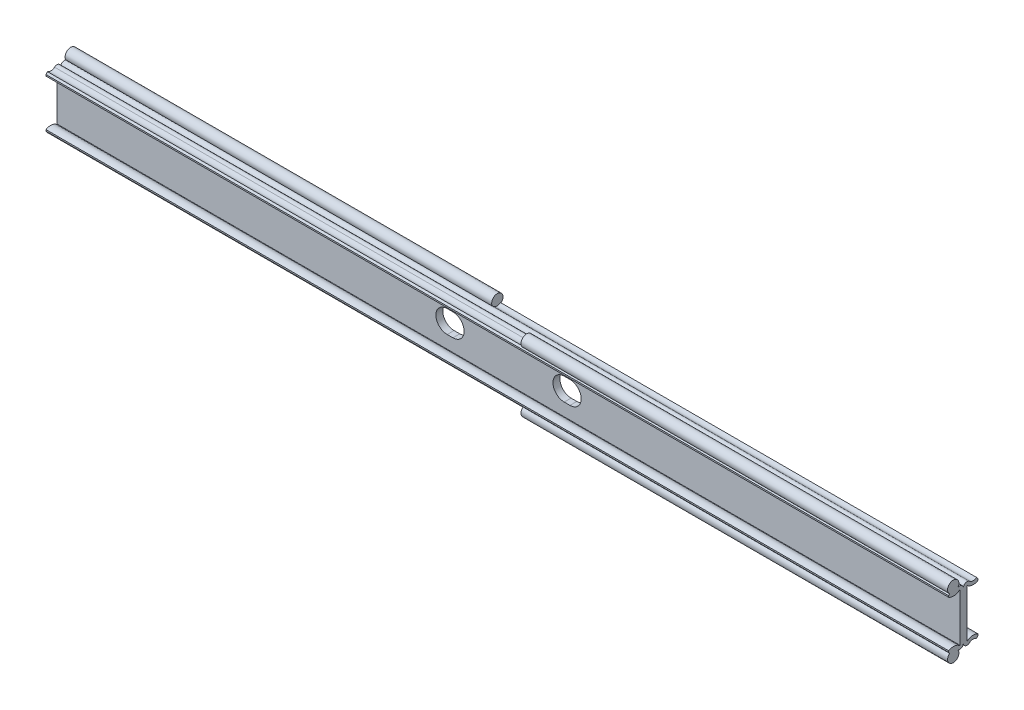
ISO-10303-21;
HEADER;
FILE_DESCRIPTION(('STEP AP214'),'2;1');
FILE_NAME('part.step','',(''),(''),'','','');
FILE_SCHEMA(('AUTOMOTIVE_DESIGN { 1 0 10303 214 1 1 1 1 }'));
ENDSEC;
DATA;
#1=APPLICATION_CONTEXT('core data for automotive mechanical design processes');
#2=APPLICATION_PROTOCOL_DEFINITION('international standard','automotive_design',2000,#1);
#3=PRODUCT_CONTEXT('',#1,'mechanical');
#4=PRODUCT('Part','Part','',(#3));
#5=PRODUCT_RELATED_PRODUCT_CATEGORY('part','',(#4));
#6=PRODUCT_DEFINITION_FORMATION('','',#4);
#7=PRODUCT_DEFINITION_CONTEXT('part definition',#1,'design');
#8=PRODUCT_DEFINITION('design','',#6,#7);
#9=PRODUCT_DEFINITION_SHAPE('','',#8);
#10=(LENGTH_UNIT() NAMED_UNIT(*) SI_UNIT(.MILLI.,.METRE.));
#11=(NAMED_UNIT(*) PLANE_ANGLE_UNIT() SI_UNIT($,.RADIAN.));
#12=(NAMED_UNIT(*) SI_UNIT($,.STERADIAN.) SOLID_ANGLE_UNIT());
#13=UNCERTAINTY_MEASURE_WITH_UNIT(LENGTH_MEASURE(1.E-05),#10,'distance_accuracy_value','');
#14=(GEOMETRIC_REPRESENTATION_CONTEXT(3) GLOBAL_UNCERTAINTY_ASSIGNED_CONTEXT((#13)) GLOBAL_UNIT_ASSIGNED_CONTEXT((#10,
#11,#12)) REPRESENTATION_CONTEXT('',''));
#15=CARTESIAN_POINT('',(0.,0.,0.));
#16=DIRECTION('',(0.,0.,1.));
#17=DIRECTION('',(1.,0.,0.));
#18=AXIS2_PLACEMENT_3D('',#15,#16,#17);
#19=CARTESIAN_POINT('',(-203.2,13.9149993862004,4.44999974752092));
#20=DIRECTION('',(1.,0.,0.));
#21=DIRECTION('',(0.,0.,-1.));
#22=AXIS2_PLACEMENT_3D('',#19,#20,#21);
#23=CYLINDRICAL_SURFACE('',#22,2.54999999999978);
#24=CARTESIAN_POINT('',(11.15,13.9149993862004,4.44999974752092));
#25=DIRECTION('',(1.,0.,0.));
#26=DIRECTION('',(0.,0.,-1.));
#27=AXIS2_PLACEMENT_3D('',#24,#25,#26);
#28=CIRCLE('',#27,2.54999999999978);
#29=CARTESIAN_POINT('',(11.15,12.0059660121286,2.75941062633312));
#30=VERTEX_POINT('',#29);
#31=CARTESIAN_POINT('',(11.15,11.8784793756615,5.98462877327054));
#32=VERTEX_POINT('',#31);
#33=EDGE_CURVE('E323',#30,#32,#28,.F.);
#34=ORIENTED_EDGE('',*,*,#33,.F.);
#35=DIRECTION('',(1.,0.,0.));
#36=VECTOR('',#35,1.);
#37=CARTESIAN_POINT('',(-203.2,12.0059660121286,2.75941062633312));
#38=LINE('',#37,#36);
#39=CARTESIAN_POINT('',(-203.2,12.0059660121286,2.75941062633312));
#40=VERTEX_POINT('',#39);
#41=EDGE_CURVE('E548',#40,#30,#38,.T.);
#42=ORIENTED_EDGE('',*,*,#41,.F.);
#43=CARTESIAN_POINT('',(-203.2,13.9149993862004,4.44999974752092));
#44=DIRECTION('',(1.,0.,0.));
#45=DIRECTION('',(0.,0.,1.));
#46=AXIS2_PLACEMENT_3D('',#43,#44,#45);
#47=CIRCLE('',#46,2.54999999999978);
#48=CARTESIAN_POINT('',(-203.2,11.8784793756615,5.98462877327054));
#49=VERTEX_POINT('',#48);
#50=EDGE_CURVE('E504',#49,#40,#47,.T.);
#51=ORIENTED_EDGE('',*,*,#50,.F.);
#52=DIRECTION('',(1.,0.,0.));
#53=VECTOR('',#52,1.);
#54=CARTESIAN_POINT('',(-203.2,11.8784793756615,5.98462877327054));
#55=LINE('',#54,#53);
#56=EDGE_CURVE('E551',#49,#32,#55,.T.);
#57=ORIENTED_EDGE('',*,*,#56,.T.);
#58=EDGE_LOOP('',(#34,#42,#51,#57));
#59=FACE_BOUND('',#58,.T.);
#60=ADVANCED_FACE('F14',(#59),#23,.F.);
#61=CARTESIAN_POINT('',(-203.2,13.9149993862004,-4.44999974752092));
#62=DIRECTION('',(1.,0.,0.));
#63=DIRECTION('',(0.,0.,-1.));
#64=AXIS2_PLACEMENT_3D('',#61,#62,#63);
#65=CYLINDRICAL_SURFACE('',#64,2.54999999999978);
#66=CARTESIAN_POINT('',(-11.15,13.9149993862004,-4.44999974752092));
#67=DIRECTION('',(-1.,0.,0.));
#68=DIRECTION('',(0.,0.,1.));
#69=AXIS2_PLACEMENT_3D('',#66,#67,#68);
#70=CIRCLE('',#69,2.54999999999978);
#71=CARTESIAN_POINT('',(-11.15,12.0059660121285,-2.75941062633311));
#72=VERTEX_POINT('',#71);
#73=CARTESIAN_POINT('',(-11.15,11.8784793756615,-5.98462877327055));
#74=VERTEX_POINT('',#73);
#75=EDGE_CURVE('E357',#72,#74,#70,.F.);
#76=ORIENTED_EDGE('',*,*,#75,.F.);
#77=DIRECTION('',(1.,0.,0.));
#78=VECTOR('',#77,1.);
#79=CARTESIAN_POINT('',(-203.2,12.0059660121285,-2.75941062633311));
#80=LINE('',#79,#78);
#81=CARTESIAN_POINT('',(203.2,12.0059660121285,-2.75941062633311));
#82=VERTEX_POINT('',#81);
#83=EDGE_CURVE('E543',#72,#82,#80,.T.);
#84=ORIENTED_EDGE('',*,*,#83,.T.);
#85=CARTESIAN_POINT('',(203.2,13.9149993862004,-4.44999974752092));
#86=DIRECTION('',(1.,0.,0.));
#87=DIRECTION('',(0.,0.,-1.));
#88=AXIS2_PLACEMENT_3D('',#85,#86,#87);
#89=CIRCLE('',#88,2.54999999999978);
#90=CARTESIAN_POINT('',(203.2,11.8784793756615,-5.98462877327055));
#91=VERTEX_POINT('',#90);
#92=EDGE_CURVE('E457',#82,#91,#89,.T.);
#93=ORIENTED_EDGE('',*,*,#92,.T.);
#94=DIRECTION('',(1.,0.,0.));
#95=VECTOR('',#94,1.);
#96=CARTESIAN_POINT('',(-203.2,11.8784793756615,-5.98462877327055));
#97=LINE('',#96,#95);
#98=EDGE_CURVE('E541',#74,#91,#97,.T.);
#99=ORIENTED_EDGE('',*,*,#98,.F.);
#100=EDGE_LOOP('',(#76,#84,#93,#99));
#101=FACE_BOUND('',#100,.T.);
#102=ADVANCED_FACE('F682',(#101),#65,.F.);
#103=CARTESIAN_POINT('',(-203.2,-13.9149993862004,-4.44999974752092));
#104=DIRECTION('',(1.,0.,0.));
#105=DIRECTION('',(0.,0.,-1.));
#106=AXIS2_PLACEMENT_3D('',#103,#104,#105);
#107=CYLINDRICAL_SURFACE('',#106,4.09999984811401);
#108=CARTESIAN_POINT('',(203.2,-13.9149993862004,-4.44999974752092));
#109=DIRECTION('',(-1.,0.,0.));
#110=DIRECTION('',(0.,0.,-1.));
#111=AXIS2_PLACEMENT_3D('',#108,#109,#110);
#112=CIRCLE('',#111,4.09999984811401);
#113=CARTESIAN_POINT('',(203.2,-10.8444021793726,-1.73312073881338));
#114=VERTEX_POINT('',#113);
#115=CARTESIAN_POINT('',(203.2,-10.4239395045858,-6.59999966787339));
#116=VERTEX_POINT('',#115);
#117=EDGE_CURVE('E423',#114,#116,#112,.T.);
#118=ORIENTED_EDGE('',*,*,#117,.T.);
#119=DIRECTION('',(1.,0.,0.));
#120=VECTOR('',#119,1.);
#121=CARTESIAN_POINT('',(-203.2,-10.4239395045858,-6.59999966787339));
#122=LINE('',#121,#120);
#123=CARTESIAN_POINT('',(-203.2,-10.4239395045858,-6.59999966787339));
#124=VERTEX_POINT('',#123);
#125=EDGE_CURVE('E591',#124,#116,#122,.T.);
#126=ORIENTED_EDGE('',*,*,#125,.F.);
#127=CARTESIAN_POINT('',(-203.2,-13.9149993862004,-4.44999974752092));
#128=DIRECTION('',(-1.,0.,0.));
#129=DIRECTION('',(0.,0.,-1.));
#130=AXIS2_PLACEMENT_3D('',#127,#128,#129);
#131=CIRCLE('',#130,4.09999984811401);
#132=CARTESIAN_POINT('',(-203.2,-10.8444021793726,-1.73312073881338));
#133=VERTEX_POINT('',#132);
#134=EDGE_CURVE('E472',#133,#124,#131,.T.);
#135=ORIENTED_EDGE('',*,*,#134,.F.);
#136=DIRECTION('',(1.,0.,0.));
#137=VECTOR('',#136,1.);
#138=CARTESIAN_POINT('',(-203.2,-10.8444021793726,-1.73312073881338));
#139=LINE('',#138,#137);
#140=EDGE_CURVE('E523',#133,#114,#139,.T.);
#141=ORIENTED_EDGE('',*,*,#140,.T.);
#142=EDGE_LOOP('',(#118,#126,#135,#141));
#143=FACE_BOUND('',#142,.T.);
#144=ADVANCED_FACE('F16',(#143),#107,.T.);
#145=CARTESIAN_POINT('',(-203.2,-11.0618535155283,-6.59999966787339));
#146=DIRECTION('',(0.,0.,1.));
#147=DIRECTION('',(1.,0.,0.));
#148=AXIS2_PLACEMENT_3D('',#145,#146,#147);
#149=PLANE('',#148);
#150=DIRECTION('',(0.,-1.,0.));
#151=VECTOR('',#150,1.);
#152=CARTESIAN_POINT('',(203.2,-11.0618535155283,-6.59999966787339));
#153=LINE('',#152,#151);
#154=CARTESIAN_POINT('',(203.2,-11.0618535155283,-6.59999966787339));
#155=VERTEX_POINT('',#154);
#156=EDGE_CURVE('E426',#116,#155,#153,.T.);
#157=ORIENTED_EDGE('',*,*,#156,.T.);
#158=DIRECTION('',(1.,0.,0.));
#159=VECTOR('',#158,1.);
#160=CARTESIAN_POINT('',(-203.2,-11.0618535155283,-6.59999966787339));
#161=LINE('',#160,#159);
#162=CARTESIAN_POINT('',(-203.2,-11.0618535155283,-6.59999966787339));
#163=VERTEX_POINT('',#162);
#164=EDGE_CURVE('E588',#163,#155,#161,.T.);
#165=ORIENTED_EDGE('',*,*,#164,.F.);
#166=DIRECTION('',(0.,-1.,0.));
#167=VECTOR('',#166,1.);
#168=CARTESIAN_POINT('',(-203.2,-11.0618535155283,-6.59999966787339));
#169=LINE('',#168,#167);
#170=EDGE_CURVE('E475',#124,#163,#169,.T.);
#171=ORIENTED_EDGE('',*,*,#170,.F.);
#172=ORIENTED_EDGE('',*,*,#125,.T.);
#173=EDGE_LOOP('',(#157,#165,#171,#172));
#174=FACE_BOUND('',#173,.T.);
#175=ADVANCED_FACE('F727',(#174),#149,.F.);
#176=CARTESIAN_POINT('',(-203.2,-11.8784793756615,-5.98462877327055));
#177=DIRECTION('',(0.,0.601814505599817,0.79863590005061));
#178=DIRECTION('',(0.,0.79863590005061,-0.601814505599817));
#179=AXIS2_PLACEMENT_3D('',#176,#177,#178);
#180=PLANE('',#179);
#181=DIRECTION('',(0.,0.79863590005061,-0.601814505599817));
#182=VECTOR('',#181,1.);
#183=CARTESIAN_POINT('',(-11.15,-11.8784793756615,-5.98462877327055));
#184=LINE('',#183,#182);
#185=CARTESIAN_POINT('',(-11.15,-11.8784793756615,-5.98462877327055));
#186=VERTEX_POINT('',#185);
#187=CARTESIAN_POINT('',(-11.15,-11.6159967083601,-6.18242338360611));
#188=VERTEX_POINT('',#187);
#189=EDGE_CURVE('E343',#186,#188,#184,.T.);
#190=ORIENTED_EDGE('',*,*,#189,.T.);
#191=DIRECTION('',(-1.,0.,0.));
#192=VECTOR('',#191,1.);
#193=CARTESIAN_POINT('',(-11.15,-11.6159967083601,-6.18242338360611));
#194=LINE('',#193,#192);
#195=CARTESIAN_POINT('',(-203.2,-11.6159967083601,-6.18242338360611));
#196=VERTEX_POINT('',#195);
#197=EDGE_CURVE('E337',#188,#196,#194,.T.);
#198=ORIENTED_EDGE('',*,*,#197,.T.);
#199=DIRECTION('',(0.,-0.79863590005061,0.601814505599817));
#200=VECTOR('',#199,1.);
#201=CARTESIAN_POINT('',(-203.2,-11.8784793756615,-5.98462877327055));
#202=LINE('',#201,#200);
#203=EDGE_CURVE('E477',#163,#196,#202,.T.);
#204=ORIENTED_EDGE('',*,*,#203,.F.);
#205=ORIENTED_EDGE('',*,*,#164,.T.);
#206=DIRECTION('',(0.,-0.79863590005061,0.601814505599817));
#207=VECTOR('',#206,1.);
#208=CARTESIAN_POINT('',(203.2,-11.8784793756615,-5.98462877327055));
#209=LINE('',#208,#207);
#210=CARTESIAN_POINT('',(203.2,-11.8784793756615,-5.98462877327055));
#211=VERTEX_POINT('',#210);
#212=EDGE_CURVE('E428',#155,#211,#209,.T.);
#213=ORIENTED_EDGE('',*,*,#212,.T.);
#214=DIRECTION('',(1.,0.,0.));
#215=VECTOR('',#214,1.);
#216=CARTESIAN_POINT('',(-203.2,-11.8784793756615,-5.98462877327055));
#217=LINE('',#216,#215);
#218=EDGE_CURVE('E586',#186,#211,#217,.T.);
#219=ORIENTED_EDGE('',*,*,#218,.F.);
#220=EDGE_LOOP('',(#190,#198,#204,#205,#213,#219));
#221=FACE_BOUND('',#220,.T.);
#222=ADVANCED_FACE('F724',(#221),#180,.F.);
#223=CARTESIAN_POINT('',(-203.2,-13.9149993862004,-4.44999974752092));
#224=DIRECTION('',(1.,0.,0.));
#225=DIRECTION('',(0.,0.,-1.));
#226=AXIS2_PLACEMENT_3D('',#223,#224,#225);
#227=CYLINDRICAL_SURFACE('',#226,2.54999999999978);
#228=DIRECTION('',(1.,0.,0.));
#229=VECTOR('',#228,1.);
#230=CARTESIAN_POINT('',(-203.2,-12.0059660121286,-2.75941062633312));
#231=LINE('',#230,#229);
#232=CARTESIAN_POINT('',(-11.15,-12.0059660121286,-2.75941062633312));
#233=VERTEX_POINT('',#232);
#234=CARTESIAN_POINT('',(203.2,-12.0059660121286,-2.75941062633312));
#235=VERTEX_POINT('',#234);
#236=EDGE_CURVE('E584',#233,#235,#231,.T.);
#237=ORIENTED_EDGE('',*,*,#236,.F.);
#238=CARTESIAN_POINT('',(-11.15,-13.9149993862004,-4.44999974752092));
#239=DIRECTION('',(1.,0.,0.));
#240=DIRECTION('',(0.,0.,-1.));
#241=AXIS2_PLACEMENT_3D('',#238,#239,#240);
#242=CIRCLE('',#241,2.54999999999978);
#243=EDGE_CURVE('E340',#233,#186,#242,.F.);
#244=ORIENTED_EDGE('',*,*,#243,.T.);
#245=ORIENTED_EDGE('',*,*,#218,.T.);
#246=CARTESIAN_POINT('',(203.2,-13.9149993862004,-4.44999974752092));
#247=DIRECTION('',(1.,0.,0.));
#248=DIRECTION('',(0.,0.,1.));
#249=AXIS2_PLACEMENT_3D('',#246,#247,#248);
#250=CIRCLE('',#249,2.54999999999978);
#251=EDGE_CURVE('E431',#211,#235,#250,.T.);
#252=ORIENTED_EDGE('',*,*,#251,.T.);
#253=EDGE_LOOP('',(#237,#244,#245,#252));
#254=FACE_BOUND('',#253,.T.);
#255=ADVANCED_FACE('F720',(#254),#227,.F.);
#256=CARTESIAN_POINT('',(-203.2,-10.7622235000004,-1.65999984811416));
#257=DIRECTION('',(1.,0.,0.));
#258=DIRECTION('',(0.,0.,-1.));
#259=AXIS2_PLACEMENT_3D('',#256,#257,#258);
#260=CYLINDRICAL_SURFACE('',#259,1.65999984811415);
#261=CARTESIAN_POINT('',(-203.2,-10.7622235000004,-1.65999984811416));
#262=DIRECTION('',(-1.,0.,0.));
#263=DIRECTION('',(0.,0.,-1.));
#264=AXIS2_PLACEMENT_3D('',#261,#262,#263);
#265=CIRCLE('',#264,1.65999984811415);
#266=CARTESIAN_POINT('',(-203.2,-12.2669165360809,-2.36106929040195));
#267=VERTEX_POINT('',#266);
#268=CARTESIAN_POINT('',(-203.2,-10.7622235,0.));
#269=VERTEX_POINT('',#268);
#270=EDGE_CURVE('E480',#267,#269,#265,.T.);
#271=ORIENTED_EDGE('',*,*,#270,.F.);
#272=DIRECTION('',(-1.,0.,0.));
#273=VECTOR('',#272,1.);
#274=CARTESIAN_POINT('',(-107.175,-12.2669165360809,-2.36106929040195));
#275=LINE('',#274,#273);
#276=CARTESIAN_POINT('',(-11.15,-12.2669165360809,-2.36106929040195));
#277=VERTEX_POINT('',#276);
#278=EDGE_CURVE('E333',#267,#277,#275,.F.);
#279=ORIENTED_EDGE('',*,*,#278,.T.);
#280=CARTESIAN_POINT('',(-11.15,-10.7622235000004,-1.65999984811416));
#281=DIRECTION('',(1.,0.,0.));
#282=DIRECTION('',(0.,0.,-1.));
#283=AXIS2_PLACEMENT_3D('',#280,#281,#282);
#284=CIRCLE('',#283,1.65999984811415);
#285=EDGE_CURVE('E596',#277,#233,#284,.T.);
#286=ORIENTED_EDGE('',*,*,#285,.T.);
#287=ORIENTED_EDGE('',*,*,#236,.T.);
#288=CARTESIAN_POINT('',(203.2,-10.7622235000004,-1.65999984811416));
#289=DIRECTION('',(-1.,0.,0.));
#290=DIRECTION('',(0.,0.,-1.));
#291=AXIS2_PLACEMENT_3D('',#288,#289,#290);
#292=CIRCLE('',#291,1.65999984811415);
#293=CARTESIAN_POINT('',(203.2,-10.7622235,0.));
#294=VERTEX_POINT('',#293);
#295=EDGE_CURVE('E434',#235,#294,#292,.T.);
#296=ORIENTED_EDGE('',*,*,#295,.T.);
#297=DIRECTION('',(1.,0.,0.));
#298=VECTOR('',#297,1.);
#299=CARTESIAN_POINT('',(-203.2,-10.7622235,0.));
#300=LINE('',#299,#298);
#301=EDGE_CURVE('E581',#269,#294,#300,.T.);
#302=ORIENTED_EDGE('',*,*,#301,.F.);
#303=EDGE_LOOP('',(#271,#279,#286,#287,#296,#302));
#304=FACE_BOUND('',#303,.T.);
#305=ADVANCED_FACE('F717',(#304),#260,.T.);
#306=CARTESIAN_POINT('',(-203.2,-10.7622235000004,1.65999984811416));
#307=DIRECTION('',(1.,0.,0.));
#308=DIRECTION('',(0.,0.,-1.));
#309=AXIS2_PLACEMENT_3D('',#306,#307,#308);
#310=CYLINDRICAL_SURFACE('',#309,1.65999984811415);
#311=CARTESIAN_POINT('',(203.2,-10.7622235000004,1.65999984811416));
#312=DIRECTION('',(-1.,0.,0.));
#313=DIRECTION('',(0.,0.,1.));
#314=AXIS2_PLACEMENT_3D('',#311,#312,#313);
#315=CIRCLE('',#314,1.65999984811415);
#316=CARTESIAN_POINT('',(203.2,-12.2669165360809,2.36106929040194));
#317=VERTEX_POINT('',#316);
#318=EDGE_CURVE('E292',#294,#317,#315,.T.);
#319=ORIENTED_EDGE('',*,*,#318,.T.);
#320=DIRECTION('',(1.,0.,0.));
#321=VECTOR('',#320,1.);
#322=CARTESIAN_POINT('',(107.175,-12.2669165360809,2.36106929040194));
#323=LINE('',#322,#321);
#324=CARTESIAN_POINT('',(11.15,-12.2669165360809,2.36106929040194));
#325=VERTEX_POINT('',#324);
#326=EDGE_CURVE('E29',#317,#325,#323,.F.);
#327=ORIENTED_EDGE('',*,*,#326,.T.);
#328=CARTESIAN_POINT('',(11.15,-10.7622235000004,1.65999984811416));
#329=DIRECTION('',(-1.,0.,0.));
#330=DIRECTION('',(0.,0.,1.));
#331=AXIS2_PLACEMENT_3D('',#328,#329,#330);
#332=CIRCLE('',#331,1.65999984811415);
#333=CARTESIAN_POINT('',(11.15,-12.0059660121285,2.75941062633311));
#334=VERTEX_POINT('',#333);
#335=EDGE_CURVE('E33',#325,#334,#332,.T.);
#336=ORIENTED_EDGE('',*,*,#335,.T.);
#337=DIRECTION('',(1.,0.,0.));
#338=VECTOR('',#337,1.);
#339=CARTESIAN_POINT('',(-203.2,-12.0059660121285,2.75941062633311));
#340=LINE('',#339,#338);
#341=CARTESIAN_POINT('',(-203.2,-12.0059660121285,2.75941062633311));
#342=VERTEX_POINT('',#341);
#343=EDGE_CURVE('E579',#342,#334,#340,.T.);
#344=ORIENTED_EDGE('',*,*,#343,.F.);
#345=CARTESIAN_POINT('',(-203.2,-10.7622235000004,1.65999984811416));
#346=DIRECTION('',(-1.,0.,0.));
#347=DIRECTION('',(0.,0.,1.));
#348=AXIS2_PLACEMENT_3D('',#345,#346,#347);
#349=CIRCLE('',#348,1.65999984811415);
#350=EDGE_CURVE('E482',#269,#342,#349,.T.);
#351=ORIENTED_EDGE('',*,*,#350,.F.);
#352=ORIENTED_EDGE('',*,*,#301,.T.);
#353=EDGE_LOOP('',(#319,#327,#336,#344,#351,#352));
#354=FACE_BOUND('',#353,.T.);
#355=ADVANCED_FACE('F714',(#354),#310,.T.);
#356=CARTESIAN_POINT('',(-203.2,-13.9149993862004,4.44999974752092));
#357=DIRECTION('',(1.,0.,0.));
#358=DIRECTION('',(0.,0.,-1.));
#359=AXIS2_PLACEMENT_3D('',#356,#357,#358);
#360=CYLINDRICAL_SURFACE('',#359,2.54999999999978);
#361=ORIENTED_EDGE('',*,*,#343,.T.);
#362=CARTESIAN_POINT('',(11.15,-13.9149993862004,4.44999974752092));
#363=DIRECTION('',(-1.,0.,0.));
#364=DIRECTION('',(0.,0.,1.));
#365=AXIS2_PLACEMENT_3D('',#362,#363,#364);
#366=CIRCLE('',#365,2.54999999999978);
#367=CARTESIAN_POINT('',(11.15,-11.8784793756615,5.98462877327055));
#368=VERTEX_POINT('',#367);
#369=EDGE_CURVE('E309',#334,#368,#366,.F.);
#370=ORIENTED_EDGE('',*,*,#369,.T.);
#371=DIRECTION('',(1.,0.,0.));
#372=VECTOR('',#371,1.);
#373=CARTESIAN_POINT('',(-203.2,-11.8784793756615,5.98462877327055));
#374=LINE('',#373,#372);
#375=CARTESIAN_POINT('',(-203.2,-11.8784793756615,5.98462877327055));
#376=VERTEX_POINT('',#375);
#377=EDGE_CURVE('E577',#376,#368,#374,.T.);
#378=ORIENTED_EDGE('',*,*,#377,.F.);
#379=CARTESIAN_POINT('',(-203.2,-13.9149993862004,4.44999974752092));
#380=DIRECTION('',(1.,0.,0.));
#381=DIRECTION('',(0.,0.,-1.));
#382=AXIS2_PLACEMENT_3D('',#379,#380,#381);
#383=CIRCLE('',#382,2.54999999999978);
#384=EDGE_CURVE('E484',#342,#376,#383,.T.);
#385=ORIENTED_EDGE('',*,*,#384,.F.);
#386=EDGE_LOOP('',(#361,#370,#378,#385));
#387=FACE_BOUND('',#386,.T.);
#388=ADVANCED_FACE('F667',(#387),#360,.F.);
#389=CARTESIAN_POINT('',(-203.2,-11.8784793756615,5.98462877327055));
#390=DIRECTION('',(0.,0.601814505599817,-0.79863590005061));
#391=DIRECTION('',(0.,-0.79863590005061,-0.601814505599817));
#392=AXIS2_PLACEMENT_3D('',#389,#390,#391);
#393=PLANE('',#392);
#394=DIRECTION('',(0.,0.79863590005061,0.601814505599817));
#395=VECTOR('',#394,1.);
#396=CARTESIAN_POINT('',(11.15,-11.8784793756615,5.98462877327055));
#397=LINE('',#396,#395);
#398=CARTESIAN_POINT('',(11.15,-11.6159967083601,6.18242338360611));
#399=VERTEX_POINT('',#398);
#400=EDGE_CURVE('E9',#368,#399,#397,.T.);
#401=ORIENTED_EDGE('',*,*,#400,.T.);
#402=DIRECTION('',(1.,0.,0.));
#403=VECTOR('',#402,1.);
#404=CARTESIAN_POINT('',(11.15,-11.6159967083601,6.18242338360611));
#405=LINE('',#404,#403);
#406=CARTESIAN_POINT('',(203.2,-11.6159967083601,6.18242338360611));
#407=VERTEX_POINT('',#406);
#408=EDGE_CURVE('E295',#399,#407,#405,.T.);
#409=ORIENTED_EDGE('',*,*,#408,.T.);
#410=DIRECTION('',(0.,0.79863590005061,0.601814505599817));
#411=VECTOR('',#410,1.);
#412=CARTESIAN_POINT('',(203.2,-11.8784793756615,5.98462877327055));
#413=LINE('',#412,#411);
#414=CARTESIAN_POINT('',(203.2,-11.0618535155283,6.59999966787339));
#415=VERTEX_POINT('',#414);
#416=EDGE_CURVE('E281',#407,#415,#413,.T.);
#417=ORIENTED_EDGE('',*,*,#416,.T.);
#418=DIRECTION('',(1.,0.,0.));
#419=VECTOR('',#418,1.);
#420=CARTESIAN_POINT('',(-203.2,-11.0618535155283,6.59999966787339));
#421=LINE('',#420,#419);
#422=CARTESIAN_POINT('',(-203.2,-11.0618535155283,6.59999966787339));
#423=VERTEX_POINT('',#422);
#424=EDGE_CURVE('E575',#423,#415,#421,.T.);
#425=ORIENTED_EDGE('',*,*,#424,.F.);
#426=DIRECTION('',(0.,0.79863590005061,0.601814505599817));
#427=VECTOR('',#426,1.);
#428=CARTESIAN_POINT('',(-203.2,-11.8784793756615,5.98462877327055));
#429=LINE('',#428,#427);
#430=EDGE_CURVE('E486',#376,#423,#429,.T.);
#431=ORIENTED_EDGE('',*,*,#430,.F.);
#432=ORIENTED_EDGE('',*,*,#377,.T.);
#433=EDGE_LOOP('',(#401,#409,#417,#425,#431,#432));
#434=FACE_BOUND('',#433,.T.);
#435=ADVANCED_FACE('F296',(#434),#393,.F.);
#436=CARTESIAN_POINT('',(-203.2,-11.0618535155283,6.59999966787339));
#437=DIRECTION('',(0.,0.,-1.));
#438=DIRECTION('',(-1.,0.,0.));
#439=AXIS2_PLACEMENT_3D('',#436,#437,#438);
#440=PLANE('',#439);
#441=DIRECTION('',(0.,1.,0.));
#442=VECTOR('',#441,1.);
#443=CARTESIAN_POINT('',(203.2,-11.0618535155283,6.59999966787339));
#444=LINE('',#443,#442);
#445=CARTESIAN_POINT('',(203.2,-10.4239395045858,6.59999966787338));
#446=VERTEX_POINT('',#445);
#447=EDGE_CURVE('E288',#415,#446,#444,.T.);
#448=ORIENTED_EDGE('',*,*,#447,.T.);
#449=DIRECTION('',(1.,0.,0.));
#450=VECTOR('',#449,1.);
#451=CARTESIAN_POINT('',(-203.2,-10.4239395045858,6.59999966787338));
#452=LINE('',#451,#450);
#453=CARTESIAN_POINT('',(-203.2,-10.4239395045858,6.59999966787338));
#454=VERTEX_POINT('',#453);
#455=EDGE_CURVE('E572',#454,#446,#452,.T.);
#456=ORIENTED_EDGE('',*,*,#455,.F.);
#457=DIRECTION('',(0.,1.,0.));
#458=VECTOR('',#457,1.);
#459=CARTESIAN_POINT('',(-203.2,-11.0618535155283,6.59999966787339));
#460=LINE('',#459,#458);
#461=EDGE_CURVE('E488',#423,#454,#460,.T.);
#462=ORIENTED_EDGE('',*,*,#461,.F.);
#463=ORIENTED_EDGE('',*,*,#424,.T.);
#464=EDGE_LOOP('',(#448,#456,#462,#463));
#465=FACE_BOUND('',#464,.T.);
#466=ADVANCED_FACE('F661',(#465),#440,.F.);
#467=CARTESIAN_POINT('',(-203.2,-13.9149993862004,4.44999974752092));
#468=DIRECTION('',(1.,0.,0.));
#469=DIRECTION('',(0.,0.,-1.));
#470=AXIS2_PLACEMENT_3D('',#467,#468,#469);
#471=CYLINDRICAL_SURFACE('',#470,4.09999984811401);
#472=CARTESIAN_POINT('',(203.2,-13.9149993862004,4.44999974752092));
#473=DIRECTION('',(-1.,0.,0.));
#474=DIRECTION('',(0.,0.,1.));
#475=AXIS2_PLACEMENT_3D('',#472,#473,#474);
#476=CIRCLE('',#475,4.09999984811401);
#477=CARTESIAN_POINT('',(203.2,-10.8444021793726,1.73312073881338));
#478=VERTEX_POINT('',#477);
#479=EDGE_CURVE('E438',#446,#478,#476,.T.);
#480=ORIENTED_EDGE('',*,*,#479,.T.);
#481=DIRECTION('',(1.,0.,0.));
#482=VECTOR('',#481,1.);
#483=CARTESIAN_POINT('',(-203.2,-10.8444021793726,1.73312073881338));
#484=LINE('',#483,#482);
#485=CARTESIAN_POINT('',(-203.2,-10.8444021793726,1.73312073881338));
#486=VERTEX_POINT('',#485);
#487=EDGE_CURVE('E569',#486,#478,#484,.T.);
#488=ORIENTED_EDGE('',*,*,#487,.F.);
#489=CARTESIAN_POINT('',(-203.2,-13.9149993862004,4.44999974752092));
#490=DIRECTION('',(-1.,0.,0.));
#491=DIRECTION('',(0.,0.,1.));
#492=AXIS2_PLACEMENT_3D('',#489,#490,#491);
#493=CIRCLE('',#492,4.09999984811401);
#494=EDGE_CURVE('E490',#454,#486,#493,.T.);
#495=ORIENTED_EDGE('',*,*,#494,.F.);
#496=ORIENTED_EDGE('',*,*,#455,.T.);
#497=EDGE_LOOP('',(#480,#488,#495,#496));
#498=FACE_BOUND('',#497,.T.);
#499=ADVANCED_FACE('F657',(#498),#471,.T.);
#500=CARTESIAN_POINT('',(-203.2,-10.7622235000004,1.65999984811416));
#501=DIRECTION('',(1.,0.,0.));
#502=DIRECTION('',(0.,0.,-1.));
#503=AXIS2_PLACEMENT_3D('',#500,#501,#502);
#504=CYLINDRICAL_SURFACE('',#503,0.110000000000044);
#505=CARTESIAN_POINT('',(203.2,-10.7622235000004,1.65999984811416));
#506=DIRECTION('',(1.,0.,0.));
#507=DIRECTION('',(0.,0.,-1.));
#508=AXIS2_PLACEMENT_3D('',#505,#506,#507);
#509=CIRCLE('',#508,0.110000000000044);
#510=CARTESIAN_POINT('',(203.2,-10.7622235,1.5499998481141));
#511=VERTEX_POINT('',#510);
#512=EDGE_CURVE('E440',#478,#511,#509,.T.);
#513=ORIENTED_EDGE('',*,*,#512,.T.);
#514=DIRECTION('',(1.,0.,0.));
#515=VECTOR('',#514,1.);
#516=CARTESIAN_POINT('',(-203.2,-10.7622235,1.5499998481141));
#517=LINE('',#516,#515);
#518=CARTESIAN_POINT('',(-203.2,-10.7622235,1.5499998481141));
#519=VERTEX_POINT('',#518);
#520=EDGE_CURVE('E566',#519,#511,#517,.T.);
#521=ORIENTED_EDGE('',*,*,#520,.F.);
#522=CARTESIAN_POINT('',(-203.2,-10.7622235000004,1.65999984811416));
#523=DIRECTION('',(1.,0.,0.));
#524=DIRECTION('',(0.,0.,-1.));
#525=AXIS2_PLACEMENT_3D('',#522,#523,#524);
#526=CIRCLE('',#525,0.110000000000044);
#527=EDGE_CURVE('E492',#486,#519,#526,.T.);
#528=ORIENTED_EDGE('',*,*,#527,.F.);
#529=ORIENTED_EDGE('',*,*,#487,.T.);
#530=EDGE_LOOP('',(#513,#521,#528,#529));
#531=FACE_BOUND('',#530,.T.);
#532=ADVANCED_FACE('F652',(#531),#504,.F.);
#533=CARTESIAN_POINT('',(-203.2,10.7622235,1.5499998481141));
#534=DIRECTION('',(0.,0.,-1.));
#535=DIRECTION('',(-1.,0.,0.));
#536=AXIS2_PLACEMENT_3D('',#533,#534,#535);
#537=PLANE('',#536);
#538=DIRECTION('',(1.,0.,0.));
#539=VECTOR('',#538,1.);
#540=CARTESIAN_POINT('',(27.65,-5.05,1.5499998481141));
#541=LINE('',#540,#539);
#542=CARTESIAN_POINT('',(25.05,-5.05,1.5499998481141));
#543=VERTEX_POINT('',#542);
#544=CARTESIAN_POINT('',(27.65,-5.05,1.5499998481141));
#545=VERTEX_POINT('',#544);
#546=EDGE_CURVE('E371',#543,#545,#541,.T.);
#547=ORIENTED_EDGE('',*,*,#546,.F.);
#548=CARTESIAN_POINT('',(25.05,0.,1.5499998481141));
#549=DIRECTION('',(0.,0.,1.));
#550=DIRECTION('',(1.,0.,0.));
#551=AXIS2_PLACEMENT_3D('',#548,#549,#550);
#552=CIRCLE('',#551,5.05);
#553=CARTESIAN_POINT('',(25.05,5.05,1.5499998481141));
#554=VERTEX_POINT('',#553);
#555=EDGE_CURVE('E369',#554,#543,#552,.T.);
#556=ORIENTED_EDGE('',*,*,#555,.F.);
#557=DIRECTION('',(-1.,0.,0.));
#558=VECTOR('',#557,1.);
#559=CARTESIAN_POINT('',(25.05,5.05,1.5499998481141));
#560=LINE('',#559,#558);
#561=CARTESIAN_POINT('',(27.65,5.05,1.5499998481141));
#562=VERTEX_POINT('',#561);
#563=EDGE_CURVE('E377',#562,#554,#560,.T.);
#564=ORIENTED_EDGE('',*,*,#563,.F.);
#565=CARTESIAN_POINT('',(27.65,0.,1.5499998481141));
#566=DIRECTION('',(0.,0.,1.));
#567=DIRECTION('',(1.,0.,0.));
#568=AXIS2_PLACEMENT_3D('',#565,#566,#567);
#569=CIRCLE('',#568,5.05);
#570=EDGE_CURVE('E374',#545,#562,#569,.T.);
#571=ORIENTED_EDGE('',*,*,#570,.F.);
#572=EDGE_LOOP('',(#547,#556,#564,#571));
#573=FACE_BOUND('',#572,.T.);
#574=DIRECTION('',(1.,0.,0.));
#575=VECTOR('',#574,1.);
#576=CARTESIAN_POINT('',(-27.65,-5.05,1.5499998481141));
#577=LINE('',#576,#575);
#578=CARTESIAN_POINT('',(-27.65,-5.05,1.5499998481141));
#579=VERTEX_POINT('',#578);
#580=CARTESIAN_POINT('',(-25.05,-5.05,1.5499998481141));
#581=VERTEX_POINT('',#580);
#582=EDGE_CURVE('E402',#579,#581,#577,.T.);
#583=ORIENTED_EDGE('',*,*,#582,.F.);
#584=CARTESIAN_POINT('',(-27.65,0.,1.5499998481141));
#585=DIRECTION('',(0.,0.,1.));
#586=DIRECTION('',(-1.,0.,0.));
#587=AXIS2_PLACEMENT_3D('',#584,#585,#586);
#588=CIRCLE('',#587,5.05);
#589=CARTESIAN_POINT('',(-27.65,5.05,1.5499998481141));
#590=VERTEX_POINT('',#589);
#591=EDGE_CURVE('E400',#590,#579,#588,.T.);
#592=ORIENTED_EDGE('',*,*,#591,.F.);
#593=DIRECTION('',(-1.,0.,0.));
#594=VECTOR('',#593,1.);
#595=CARTESIAN_POINT('',(-25.05,5.05,1.5499998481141));
#596=LINE('',#595,#594);
#597=CARTESIAN_POINT('',(-25.05,5.05,1.5499998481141));
#598=VERTEX_POINT('',#597);
#599=EDGE_CURVE('E408',#598,#590,#596,.T.);
#600=ORIENTED_EDGE('',*,*,#599,.F.);
#601=CARTESIAN_POINT('',(-25.05,0.,1.5499998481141));
#602=DIRECTION('',(0.,0.,1.));
#603=DIRECTION('',(-1.,0.,0.));
#604=AXIS2_PLACEMENT_3D('',#601,#602,#603);
#605=CIRCLE('',#604,5.05);
#606=EDGE_CURVE('E405',#581,#598,#605,.T.);
#607=ORIENTED_EDGE('',*,*,#606,.F.);
#608=EDGE_LOOP('',(#583,#592,#600,#607));
#609=FACE_BOUND('',#608,.T.);
#610=DIRECTION('',(0.,1.,0.));
#611=VECTOR('',#610,1.);
#612=CARTESIAN_POINT('',(203.2,10.7622235,1.5499998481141));
#613=LINE('',#612,#611);
#614=CARTESIAN_POINT('',(203.2,10.7622235,1.54999984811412));
#615=VERTEX_POINT('',#614);
#616=EDGE_CURVE('E442',#511,#615,#613,.T.);
#617=ORIENTED_EDGE('',*,*,#616,.T.);
#618=DIRECTION('',(1.,0.,0.));
#619=VECTOR('',#618,1.);
#620=CARTESIAN_POINT('',(-203.2,10.7622235,1.54999984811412));
#621=LINE('',#620,#619);
#622=CARTESIAN_POINT('',(-203.2,10.7622235,1.54999984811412));
#623=VERTEX_POINT('',#622);
#624=EDGE_CURVE('E563',#623,#615,#621,.T.);
#625=ORIENTED_EDGE('',*,*,#624,.F.);
#626=DIRECTION('',(0.,1.,0.));
#627=VECTOR('',#626,1.);
#628=CARTESIAN_POINT('',(-203.2,10.7622235,1.5499998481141));
#629=LINE('',#628,#627);
#630=EDGE_CURVE('E494',#519,#623,#629,.T.);
#631=ORIENTED_EDGE('',*,*,#630,.F.);
#632=ORIENTED_EDGE('',*,*,#520,.T.);
#633=EDGE_LOOP('',(#617,#625,#631,#632));
#634=FACE_BOUND('',#633,.T.);
#635=ADVANCED_FACE('F648',(#573,#609,#634),#537,.F.);
#636=CARTESIAN_POINT('',(-203.2,10.7622235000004,1.65999984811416));
#637=DIRECTION('',(1.,0.,0.));
#638=DIRECTION('',(0.,0.,-1.));
#639=AXIS2_PLACEMENT_3D('',#636,#637,#638);
#640=CYLINDRICAL_SURFACE('',#639,0.110000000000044);
#641=CARTESIAN_POINT('',(203.2,10.7622235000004,1.65999984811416));
#642=DIRECTION('',(1.,0.,0.));
#643=DIRECTION('',(0.,0.,1.));
#644=AXIS2_PLACEMENT_3D('',#641,#642,#643);
#645=CIRCLE('',#644,0.110000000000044);
#646=CARTESIAN_POINT('',(203.2,10.8444021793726,1.73312073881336));
#647=VERTEX_POINT('',#646);
#648=EDGE_CURVE('E444',#615,#647,#645,.T.);
#649=ORIENTED_EDGE('',*,*,#648,.T.);
#650=DIRECTION('',(1.,0.,0.));
#651=VECTOR('',#650,1.);
#652=CARTESIAN_POINT('',(-203.2,10.8444021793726,1.73312073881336));
#653=LINE('',#652,#651);
#654=CARTESIAN_POINT('',(-203.2,10.8444021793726,1.73312073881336));
#655=VERTEX_POINT('',#654);
#656=EDGE_CURVE('E560',#655,#647,#653,.T.);
#657=ORIENTED_EDGE('',*,*,#656,.F.);
#658=CARTESIAN_POINT('',(-203.2,10.7622235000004,1.65999984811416));
#659=DIRECTION('',(1.,0.,0.));
#660=DIRECTION('',(0.,0.,1.));
#661=AXIS2_PLACEMENT_3D('',#658,#659,#660);
#662=CIRCLE('',#661,0.110000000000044);
#663=EDGE_CURVE('E496',#623,#655,#662,.T.);
#664=ORIENTED_EDGE('',*,*,#663,.F.);
#665=ORIENTED_EDGE('',*,*,#624,.T.);
#666=EDGE_LOOP('',(#649,#657,#664,#665));
#667=FACE_BOUND('',#666,.T.);
#668=ADVANCED_FACE('F644',(#667),#640,.F.);
#669=CARTESIAN_POINT('',(-203.2,13.9149993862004,4.44999974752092));
#670=DIRECTION('',(1.,0.,0.));
#671=DIRECTION('',(0.,0.,-1.));
#672=AXIS2_PLACEMENT_3D('',#669,#670,#671);
#673=CYLINDRICAL_SURFACE('',#672,4.09999984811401);
#674=CARTESIAN_POINT('',(203.2,13.9149993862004,4.44999974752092));
#675=DIRECTION('',(-1.,0.,0.));
#676=DIRECTION('',(0.,0.,-1.));
#677=AXIS2_PLACEMENT_3D('',#674,#675,#676);
#678=CIRCLE('',#677,4.09999984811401);
#679=CARTESIAN_POINT('',(203.2,10.4239395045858,6.59999966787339));
#680=VERTEX_POINT('',#679);
#681=EDGE_CURVE('E446',#647,#680,#678,.T.);
#682=ORIENTED_EDGE('',*,*,#681,.T.);
#683=DIRECTION('',(1.,0.,0.));
#684=VECTOR('',#683,1.);
#685=CARTESIAN_POINT('',(-203.2,10.4239395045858,6.59999966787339));
#686=LINE('',#685,#684);
#687=CARTESIAN_POINT('',(-203.2,10.4239395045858,6.59999966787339));
#688=VERTEX_POINT('',#687);
#689=EDGE_CURVE('E557',#688,#680,#686,.T.);
#690=ORIENTED_EDGE('',*,*,#689,.F.);
#691=CARTESIAN_POINT('',(-203.2,13.9149993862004,4.44999974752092));
#692=DIRECTION('',(-1.,0.,0.));
#693=DIRECTION('',(0.,0.,-1.));
#694=AXIS2_PLACEMENT_3D('',#691,#692,#693);
#695=CIRCLE('',#694,4.09999984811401);
#696=EDGE_CURVE('E498',#655,#688,#695,.T.);
#697=ORIENTED_EDGE('',*,*,#696,.F.);
#698=ORIENTED_EDGE('',*,*,#656,.T.);
#699=EDGE_LOOP('',(#682,#690,#697,#698));
#700=FACE_BOUND('',#699,.T.);
#701=ADVANCED_FACE('F639',(#700),#673,.T.);
#702=CARTESIAN_POINT('',(-203.2,11.0618535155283,6.59999966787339));
#703=DIRECTION('',(0.,0.,-1.));
#704=DIRECTION('',(-1.,0.,0.));
#705=AXIS2_PLACEMENT_3D('',#702,#703,#704);
#706=PLANE('',#705);
#707=DIRECTION('',(0.,1.,0.));
#708=VECTOR('',#707,1.);
#709=CARTESIAN_POINT('',(203.2,11.0618535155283,6.59999966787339));
#710=LINE('',#709,#708);
#711=CARTESIAN_POINT('',(203.2,11.0618535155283,6.59999966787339));
#712=VERTEX_POINT('',#711);
#713=EDGE_CURVE('E448',#680,#712,#710,.T.);
#714=ORIENTED_EDGE('',*,*,#713,.T.);
#715=DIRECTION('',(1.,0.,0.));
#716=VECTOR('',#715,1.);
#717=CARTESIAN_POINT('',(-203.2,11.0618535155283,6.59999966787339));
#718=LINE('',#717,#716);
#719=CARTESIAN_POINT('',(-203.2,11.0618535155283,6.59999966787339));
#720=VERTEX_POINT('',#719);
#721=EDGE_CURVE('E554',#720,#712,#718,.T.);
#722=ORIENTED_EDGE('',*,*,#721,.F.);
#723=DIRECTION('',(0.,1.,0.));
#724=VECTOR('',#723,1.);
#725=CARTESIAN_POINT('',(-203.2,11.0618535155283,6.59999966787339));
#726=LINE('',#725,#724);
#727=EDGE_CURVE('E500',#688,#720,#726,.T.);
#728=ORIENTED_EDGE('',*,*,#727,.F.);
#729=ORIENTED_EDGE('',*,*,#689,.T.);
#730=EDGE_LOOP('',(#714,#722,#728,#729));
#731=FACE_BOUND('',#730,.T.);
#732=ADVANCED_FACE('F633',(#731),#706,.F.);
#733=CARTESIAN_POINT('',(-203.2,11.8784793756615,5.98462877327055));
#734=DIRECTION('',(0.,-0.601814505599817,-0.79863590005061));
#735=DIRECTION('',(0.,-0.79863590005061,0.601814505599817));
#736=AXIS2_PLACEMENT_3D('',#733,#734,#735);
#737=PLANE('',#736);
#738=DIRECTION('',(0.,0.79863590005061,-0.601814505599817));
#739=VECTOR('',#738,1.);
#740=CARTESIAN_POINT('',(203.2,11.8784793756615,5.98462877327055));
#741=LINE('',#740,#739);
#742=CARTESIAN_POINT('',(203.2,11.6159967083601,6.18242338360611));
#743=VERTEX_POINT('',#742);
#744=EDGE_CURVE('E450',#712,#743,#741,.T.);
#745=ORIENTED_EDGE('',*,*,#744,.T.);
#746=DIRECTION('',(1.,0.,0.));
#747=VECTOR('',#746,1.);
#748=CARTESIAN_POINT('',(11.15,11.6159967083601,6.18242338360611));
#749=LINE('',#748,#747);
#750=CARTESIAN_POINT('',(11.15,11.6159967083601,6.18242338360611));
#751=VERTEX_POINT('',#750);
#752=EDGE_CURVE('E321',#743,#751,#749,.F.);
#753=ORIENTED_EDGE('',*,*,#752,.T.);
#754=DIRECTION('',(0.,-0.79863590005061,0.601814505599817));
#755=VECTOR('',#754,1.);
#756=CARTESIAN_POINT('',(11.15,11.8784793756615,5.98462877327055));
#757=LINE('',#756,#755);
#758=EDGE_CURVE('E326',#32,#751,#757,.T.);
#759=ORIENTED_EDGE('',*,*,#758,.F.);
#760=ORIENTED_EDGE('',*,*,#56,.F.);
#761=DIRECTION('',(0.,0.79863590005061,-0.601814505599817));
#762=VECTOR('',#761,1.);
#763=CARTESIAN_POINT('',(-203.2,11.8784793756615,5.98462877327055));
#764=LINE('',#763,#762);
#765=EDGE_CURVE('E502',#720,#49,#764,.T.);
#766=ORIENTED_EDGE('',*,*,#765,.F.);
#767=ORIENTED_EDGE('',*,*,#721,.T.);
#768=EDGE_LOOP('',(#745,#753,#759,#760,#766,#767));
#769=FACE_BOUND('',#768,.T.);
#770=ADVANCED_FACE('F629',(#769),#737,.F.);
#771=CARTESIAN_POINT('',(-203.2,10.7622235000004,1.65999984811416));
#772=DIRECTION('',(1.,0.,0.));
#773=DIRECTION('',(0.,0.,-1.));
#774=AXIS2_PLACEMENT_3D('',#771,#772,#773);
#775=CYLINDRICAL_SURFACE('',#774,1.65999984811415);
#776=CARTESIAN_POINT('',(11.15,10.7622235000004,1.65999984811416));
#777=DIRECTION('',(1.,0.,0.));
#778=DIRECTION('',(0.,0.,-1.));
#779=AXIS2_PLACEMENT_3D('',#776,#777,#778);
#780=CIRCLE('',#779,1.65999984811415);
#781=CARTESIAN_POINT('',(11.15,12.2669165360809,2.36106929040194));
#782=VERTEX_POINT('',#781);
#783=EDGE_CURVE('E22',#782,#30,#780,.T.);
#784=ORIENTED_EDGE('',*,*,#783,.F.);
#785=DIRECTION('',(1.,0.,0.));
#786=VECTOR('',#785,1.);
#787=CARTESIAN_POINT('',(107.175,12.2669165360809,2.36106929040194));
#788=LINE('',#787,#786);
#789=CARTESIAN_POINT('',(203.2,12.2669165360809,2.36106929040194));
#790=VERTEX_POINT('',#789);
#791=EDGE_CURVE('E316',#782,#790,#788,.T.);
#792=ORIENTED_EDGE('',*,*,#791,.T.);
#793=CARTESIAN_POINT('',(203.2,10.7622235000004,1.65999984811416));
#794=DIRECTION('',(-1.,0.,0.));
#795=DIRECTION('',(0.,0.,-1.));
#796=AXIS2_PLACEMENT_3D('',#793,#794,#795);
#797=CIRCLE('',#796,1.65999984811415);
#798=CARTESIAN_POINT('',(203.2,10.7622235,0.));
#799=VERTEX_POINT('',#798);
#800=EDGE_CURVE('E452',#790,#799,#797,.T.);
#801=ORIENTED_EDGE('',*,*,#800,.T.);
#802=DIRECTION('',(1.,0.,0.));
#803=VECTOR('',#802,1.);
#804=CARTESIAN_POINT('',(-203.2,10.7622235,0.));
#805=LINE('',#804,#803);
#806=CARTESIAN_POINT('',(-203.2,10.7622235,0.));
#807=VERTEX_POINT('',#806);
#808=EDGE_CURVE('E545',#807,#799,#805,.T.);
#809=ORIENTED_EDGE('',*,*,#808,.F.);
#810=CARTESIAN_POINT('',(-203.2,10.7622235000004,1.65999984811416));
#811=DIRECTION('',(-1.,0.,0.));
#812=DIRECTION('',(0.,0.,-1.));
#813=AXIS2_PLACEMENT_3D('',#810,#811,#812);
#814=CIRCLE('',#813,1.65999984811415);
#815=EDGE_CURVE('E506',#40,#807,#814,.T.);
#816=ORIENTED_EDGE('',*,*,#815,.F.);
#817=ORIENTED_EDGE('',*,*,#41,.T.);
#818=EDGE_LOOP('',(#784,#792,#801,#809,#816,#817));
#819=FACE_BOUND('',#818,.T.);
#820=ADVANCED_FACE('F604',(#819),#775,.T.);
#821=CARTESIAN_POINT('',(-203.2,10.7622235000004,-1.65999984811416));
#822=DIRECTION('',(1.,0.,0.));
#823=DIRECTION('',(0.,0.,-1.));
#824=AXIS2_PLACEMENT_3D('',#821,#822,#823);
#825=CYLINDRICAL_SURFACE('',#824,1.65999984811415);
#826=CARTESIAN_POINT('',(-11.15,10.7622235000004,-1.65999984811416));
#827=DIRECTION('',(-1.,0.,0.));
#828=DIRECTION('',(0.,0.,1.));
#829=AXIS2_PLACEMENT_3D('',#826,#827,#828);
#830=CIRCLE('',#829,1.65999984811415);
#831=CARTESIAN_POINT('',(-11.15,12.2669165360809,-2.36106929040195));
#832=VERTEX_POINT('',#831);
#833=EDGE_CURVE('E359',#832,#72,#830,.T.);
#834=ORIENTED_EDGE('',*,*,#833,.F.);
#835=DIRECTION('',(-1.,0.,0.));
#836=VECTOR('',#835,1.);
#837=CARTESIAN_POINT('',(-107.175,12.2669165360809,-2.36106929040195));
#838=LINE('',#837,#836);
#839=CARTESIAN_POINT('',(-203.2,12.2669165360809,-2.36106929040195));
#840=VERTEX_POINT('',#839);
#841=EDGE_CURVE('E354',#832,#840,#838,.T.);
#842=ORIENTED_EDGE('',*,*,#841,.T.);
#843=CARTESIAN_POINT('',(-203.2,10.7622235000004,-1.65999984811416));
#844=DIRECTION('',(-1.,0.,0.));
#845=DIRECTION('',(0.,0.,1.));
#846=AXIS2_PLACEMENT_3D('',#843,#844,#845);
#847=CIRCLE('',#846,1.65999984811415);
#848=EDGE_CURVE('E508',#807,#840,#847,.T.);
#849=ORIENTED_EDGE('',*,*,#848,.F.);
#850=ORIENTED_EDGE('',*,*,#808,.T.);
#851=CARTESIAN_POINT('',(203.2,10.7622235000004,-1.65999984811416));
#852=DIRECTION('',(-1.,0.,0.));
#853=DIRECTION('',(0.,0.,1.));
#854=AXIS2_PLACEMENT_3D('',#851,#852,#853);
#855=CIRCLE('',#854,1.65999984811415);
#856=EDGE_CURVE('E454',#799,#82,#855,.T.);
#857=ORIENTED_EDGE('',*,*,#856,.T.);
#858=ORIENTED_EDGE('',*,*,#83,.F.);
#859=EDGE_LOOP('',(#834,#842,#849,#850,#857,#858));
#860=FACE_BOUND('',#859,.T.);
#861=ADVANCED_FACE('F619',(#860),#825,.T.);
#862=CARTESIAN_POINT('',(-203.2,11.8784793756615,-5.98462877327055));
#863=DIRECTION('',(0.,-0.601814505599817,0.79863590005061));
#864=DIRECTION('',(0.,0.79863590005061,0.601814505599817));
#865=AXIS2_PLACEMENT_3D('',#862,#863,#864);
#866=PLANE('',#865);
#867=DIRECTION('',(0.,-0.79863590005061,-0.601814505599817));
#868=VECTOR('',#867,1.);
#869=CARTESIAN_POINT('',(-203.2,11.8784793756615,-5.98462877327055));
#870=LINE('',#869,#868);
#871=CARTESIAN_POINT('',(-203.2,11.6159967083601,-6.18242338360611));
#872=VERTEX_POINT('',#871);
#873=CARTESIAN_POINT('',(-203.2,11.0618535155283,-6.59999966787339));
#874=VERTEX_POINT('',#873);
#875=EDGE_CURVE('E511',#872,#874,#870,.T.);
#876=ORIENTED_EDGE('',*,*,#875,.F.);
#877=DIRECTION('',(-1.,0.,0.));
#878=VECTOR('',#877,1.);
#879=CARTESIAN_POINT('',(-11.15,11.6159967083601,-6.18242338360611));
#880=LINE('',#879,#878);
#881=CARTESIAN_POINT('',(-11.15,11.6159967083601,-6.18242338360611));
#882=VERTEX_POINT('',#881);
#883=EDGE_CURVE('E350',#872,#882,#880,.F.);
#884=ORIENTED_EDGE('',*,*,#883,.T.);
#885=DIRECTION('',(0.,-0.79863590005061,-0.601814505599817));
#886=VECTOR('',#885,1.);
#887=CARTESIAN_POINT('',(-11.15,11.8784793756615,-5.98462877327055));
#888=LINE('',#887,#886);
#889=EDGE_CURVE('E594',#74,#882,#888,.T.);
#890=ORIENTED_EDGE('',*,*,#889,.F.);
#891=ORIENTED_EDGE('',*,*,#98,.T.);
#892=DIRECTION('',(0.,-0.79863590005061,-0.601814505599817));
#893=VECTOR('',#892,1.);
#894=CARTESIAN_POINT('',(203.2,11.8784793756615,-5.98462877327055));
#895=LINE('',#894,#893);
#896=CARTESIAN_POINT('',(203.2,11.0618535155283,-6.59999966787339));
#897=VERTEX_POINT('',#896);
#898=EDGE_CURVE('E460',#91,#897,#895,.T.);
#899=ORIENTED_EDGE('',*,*,#898,.T.);
#900=DIRECTION('',(1.,0.,0.));
#901=VECTOR('',#900,1.);
#902=CARTESIAN_POINT('',(-203.2,11.0618535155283,-6.59999966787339));
#903=LINE('',#902,#901);
#904=EDGE_CURVE('E538',#874,#897,#903,.T.);
#905=ORIENTED_EDGE('',*,*,#904,.F.);
#906=EDGE_LOOP('',(#876,#884,#890,#891,#899,#905));
#907=FACE_BOUND('',#906,.T.);
#908=ADVANCED_FACE('F783',(#907),#866,.F.);
#909=CARTESIAN_POINT('',(-203.2,11.0618535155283,-6.59999966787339));
#910=DIRECTION('',(0.,0.,1.));
#911=DIRECTION('',(1.,0.,0.));
#912=AXIS2_PLACEMENT_3D('',#909,#910,#911);
#913=PLANE('',#912);
#914=DIRECTION('',(0.,-1.,0.));
#915=VECTOR('',#914,1.);
#916=CARTESIAN_POINT('',(203.2,11.0618535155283,-6.59999966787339));
#917=LINE('',#916,#915);
#918=CARTESIAN_POINT('',(203.2,10.4239395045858,-6.59999966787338));
#919=VERTEX_POINT('',#918);
#920=EDGE_CURVE('E462',#897,#919,#917,.T.);
#921=ORIENTED_EDGE('',*,*,#920,.T.);
#922=DIRECTION('',(1.,0.,0.));
#923=VECTOR('',#922,1.);
#924=CARTESIAN_POINT('',(-203.2,10.4239395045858,-6.59999966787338));
#925=LINE('',#924,#923);
#926=CARTESIAN_POINT('',(-203.2,10.4239395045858,-6.59999966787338));
#927=VERTEX_POINT('',#926);
#928=EDGE_CURVE('E535',#927,#919,#925,.T.);
#929=ORIENTED_EDGE('',*,*,#928,.F.);
#930=DIRECTION('',(0.,-1.,0.));
#931=VECTOR('',#930,1.);
#932=CARTESIAN_POINT('',(-203.2,11.0618535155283,-6.59999966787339));
#933=LINE('',#932,#931);
#934=EDGE_CURVE('E513',#874,#927,#933,.T.);
#935=ORIENTED_EDGE('',*,*,#934,.F.);
#936=ORIENTED_EDGE('',*,*,#904,.T.);
#937=EDGE_LOOP('',(#921,#929,#935,#936));
#938=FACE_BOUND('',#937,.T.);
#939=ADVANCED_FACE('F779',(#938),#913,.F.);
#940=CARTESIAN_POINT('',(-203.2,13.9149993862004,-4.44999974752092));
#941=DIRECTION('',(1.,0.,0.));
#942=DIRECTION('',(0.,0.,-1.));
#943=AXIS2_PLACEMENT_3D('',#940,#941,#942);
#944=CYLINDRICAL_SURFACE('',#943,4.09999984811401);
#945=CARTESIAN_POINT('',(203.2,13.9149993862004,-4.44999974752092));
#946=DIRECTION('',(-1.,0.,0.));
#947=DIRECTION('',(0.,0.,1.));
#948=AXIS2_PLACEMENT_3D('',#945,#946,#947);
#949=CIRCLE('',#948,4.09999984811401);
#950=CARTESIAN_POINT('',(203.2,10.8444021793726,-1.73312073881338));
#951=VERTEX_POINT('',#950);
#952=EDGE_CURVE('E464',#919,#951,#949,.T.);
#953=ORIENTED_EDGE('',*,*,#952,.T.);
#954=DIRECTION('',(1.,0.,0.));
#955=VECTOR('',#954,1.);
#956=CARTESIAN_POINT('',(-203.2,10.8444021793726,-1.73312073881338));
#957=LINE('',#956,#955);
#958=CARTESIAN_POINT('',(-203.2,10.8444021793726,-1.73312073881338));
#959=VERTEX_POINT('',#958);
#960=EDGE_CURVE('E532',#959,#951,#957,.T.);
#961=ORIENTED_EDGE('',*,*,#960,.F.);
#962=CARTESIAN_POINT('',(-203.2,13.9149993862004,-4.44999974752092));
#963=DIRECTION('',(-1.,0.,0.));
#964=DIRECTION('',(0.,0.,1.));
#965=AXIS2_PLACEMENT_3D('',#962,#963,#964);
#966=CIRCLE('',#965,4.09999984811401);
#967=EDGE_CURVE('E515',#927,#959,#966,.T.);
#968=ORIENTED_EDGE('',*,*,#967,.F.);
#969=ORIENTED_EDGE('',*,*,#928,.T.);
#970=EDGE_LOOP('',(#953,#961,#968,#969));
#971=FACE_BOUND('',#970,.T.);
#972=ADVANCED_FACE('F774',(#971),#944,.T.);
#973=CARTESIAN_POINT('',(-203.2,10.7622235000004,-1.65999984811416));
#974=DIRECTION('',(1.,0.,0.));
#975=DIRECTION('',(0.,0.,-1.));
#976=AXIS2_PLACEMENT_3D('',#973,#974,#975);
#977=CYLINDRICAL_SURFACE('',#976,0.110000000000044);
#978=CARTESIAN_POINT('',(203.2,10.7622235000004,-1.65999984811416));
#979=DIRECTION('',(1.,0.,0.));
#980=DIRECTION('',(0.,0.,-1.));
#981=AXIS2_PLACEMENT_3D('',#978,#979,#980);
#982=CIRCLE('',#981,0.110000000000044);
#983=CARTESIAN_POINT('',(203.2,10.7622235,-1.5499998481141));
#984=VERTEX_POINT('',#983);
#985=EDGE_CURVE('E466',#951,#984,#982,.T.);
#986=ORIENTED_EDGE('',*,*,#985,.T.);
#987=DIRECTION('',(1.,0.,0.));
#988=VECTOR('',#987,1.);
#989=CARTESIAN_POINT('',(-203.2,10.7622235,-1.5499998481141));
#990=LINE('',#989,#988);
#991=CARTESIAN_POINT('',(-203.2,10.7622235,-1.5499998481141));
#992=VERTEX_POINT('',#991);
#993=EDGE_CURVE('E529',#992,#984,#990,.T.);
#994=ORIENTED_EDGE('',*,*,#993,.F.);
#995=CARTESIAN_POINT('',(-203.2,10.7622235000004,-1.65999984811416));
#996=DIRECTION('',(1.,0.,0.));
#997=DIRECTION('',(0.,0.,-1.));
#998=AXIS2_PLACEMENT_3D('',#995,#996,#997);
#999=CIRCLE('',#998,0.110000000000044);
#1000=EDGE_CURVE('E517',#959,#992,#999,.T.);
#1001=ORIENTED_EDGE('',*,*,#1000,.F.);
#1002=ORIENTED_EDGE('',*,*,#960,.T.);
#1003=EDGE_LOOP('',(#986,#994,#1001,#1002));
#1004=FACE_BOUND('',#1003,.T.);
#1005=ADVANCED_FACE('F768',(#1004),#977,.F.);
#1006=CARTESIAN_POINT('',(-203.2,10.7622235,-1.5499998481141));
#1007=DIRECTION('',(0.,0.,1.));
#1008=DIRECTION('',(1.,0.,0.));
#1009=AXIS2_PLACEMENT_3D('',#1006,#1007,#1008);
#1010=PLANE('',#1009);
#1011=DIRECTION('',(1.,0.,0.));
#1012=VECTOR('',#1011,1.);
#1013=CARTESIAN_POINT('',(25.05,5.05,-1.5499998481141));
#1014=LINE('',#1013,#1012);
#1015=CARTESIAN_POINT('',(25.05,5.05,-1.5499998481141));
#1016=VERTEX_POINT('',#1015);
#1017=CARTESIAN_POINT('',(27.65,5.05,-1.5499998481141));
#1018=VERTEX_POINT('',#1017);
#1019=EDGE_CURVE('E363',#1016,#1018,#1014,.T.);
#1020=ORIENTED_EDGE('',*,*,#1019,.F.);
#1021=CARTESIAN_POINT('',(25.05,0.,-1.5499998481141));
#1022=DIRECTION('',(0.,0.,1.));
#1023=DIRECTION('',(1.,0.,0.));
#1024=AXIS2_PLACEMENT_3D('',#1021,#1022,#1023);
#1025=CIRCLE('',#1024,5.05);
#1026=CARTESIAN_POINT('',(25.05,-5.05,-1.5499998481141));
#1027=VERTEX_POINT('',#1026);
#1028=EDGE_CURVE('E366',#1027,#1016,#1025,.F.);
#1029=ORIENTED_EDGE('',*,*,#1028,.F.);
#1030=DIRECTION('',(-1.,0.,0.));
#1031=VECTOR('',#1030,1.);
#1032=CARTESIAN_POINT('',(27.65,-5.05,-1.5499998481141));
#1033=LINE('',#1032,#1031);
#1034=CARTESIAN_POINT('',(27.65,-5.05,-1.5499998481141));
#1035=VERTEX_POINT('',#1034);
#1036=EDGE_CURVE('E383',#1035,#1027,#1033,.T.);
#1037=ORIENTED_EDGE('',*,*,#1036,.F.);
#1038=CARTESIAN_POINT('',(27.65,0.,-1.5499998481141));
#1039=DIRECTION('',(0.,0.,1.));
#1040=DIRECTION('',(1.,0.,0.));
#1041=AXIS2_PLACEMENT_3D('',#1038,#1039,#1040);
#1042=CIRCLE('',#1041,5.05);
#1043=EDGE_CURVE('E361',#1018,#1035,#1042,.F.);
#1044=ORIENTED_EDGE('',*,*,#1043,.F.);
#1045=EDGE_LOOP('',(#1020,#1029,#1037,#1044));
#1046=FACE_BOUND('',#1045,.T.);
#1047=DIRECTION('',(1.,0.,0.));
#1048=VECTOR('',#1047,1.);
#1049=CARTESIAN_POINT('',(-25.05,5.05,-1.5499998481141));
#1050=LINE('',#1049,#1048);
#1051=CARTESIAN_POINT('',(-27.65,5.05,-1.5499998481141));
#1052=VERTEX_POINT('',#1051);
#1053=CARTESIAN_POINT('',(-25.05,5.05,-1.5499998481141));
#1054=VERTEX_POINT('',#1053);
#1055=EDGE_CURVE('E394',#1052,#1054,#1050,.T.);
#1056=ORIENTED_EDGE('',*,*,#1055,.F.);
#1057=CARTESIAN_POINT('',(-27.65,0.,-1.5499998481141));
#1058=DIRECTION('',(0.,0.,1.));
#1059=DIRECTION('',(1.,0.,0.));
#1060=AXIS2_PLACEMENT_3D('',#1057,#1058,#1059);
#1061=CIRCLE('',#1060,5.05);
#1062=CARTESIAN_POINT('',(-27.65,-5.05,-1.5499998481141));
#1063=VERTEX_POINT('',#1062);
#1064=EDGE_CURVE('E397',#1063,#1052,#1061,.F.);
#1065=ORIENTED_EDGE('',*,*,#1064,.F.);
#1066=DIRECTION('',(-1.,0.,0.));
#1067=VECTOR('',#1066,1.);
#1068=CARTESIAN_POINT('',(-27.65,-5.05,-1.5499998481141));
#1069=LINE('',#1068,#1067);
#1070=CARTESIAN_POINT('',(-25.05,-5.05,-1.5499998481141));
#1071=VERTEX_POINT('',#1070);
#1072=EDGE_CURVE('E414',#1071,#1063,#1069,.T.);
#1073=ORIENTED_EDGE('',*,*,#1072,.F.);
#1074=CARTESIAN_POINT('',(-25.05,0.,-1.5499998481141));
#1075=DIRECTION('',(0.,0.,1.));
#1076=DIRECTION('',(1.,0.,0.));
#1077=AXIS2_PLACEMENT_3D('',#1074,#1075,#1076);
#1078=CIRCLE('',#1077,5.05);
#1079=EDGE_CURVE('E392',#1054,#1071,#1078,.F.);
#1080=ORIENTED_EDGE('',*,*,#1079,.F.);
#1081=EDGE_LOOP('',(#1056,#1065,#1073,#1080));
#1082=FACE_BOUND('',#1081,.T.);
#1083=DIRECTION('',(0.,-1.,0.));
#1084=VECTOR('',#1083,1.);
#1085=CARTESIAN_POINT('',(203.2,10.7622235,-1.5499998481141));
#1086=LINE('',#1085,#1084);
#1087=CARTESIAN_POINT('',(203.2,-10.7622235,-1.54999984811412));
#1088=VERTEX_POINT('',#1087);
#1089=EDGE_CURVE('E468',#984,#1088,#1086,.T.);
#1090=ORIENTED_EDGE('',*,*,#1089,.T.);
#1091=DIRECTION('',(1.,0.,0.));
#1092=VECTOR('',#1091,1.);
#1093=CARTESIAN_POINT('',(-203.2,-10.7622235,-1.54999984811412));
#1094=LINE('',#1093,#1092);
#1095=CARTESIAN_POINT('',(-203.2,-10.7622235,-1.54999984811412));
#1096=VERTEX_POINT('',#1095);
#1097=EDGE_CURVE('E526',#1096,#1088,#1094,.T.);
#1098=ORIENTED_EDGE('',*,*,#1097,.F.);
#1099=DIRECTION('',(0.,-1.,0.));
#1100=VECTOR('',#1099,1.);
#1101=CARTESIAN_POINT('',(-203.2,10.7622235,-1.5499998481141));
#1102=LINE('',#1101,#1100);
#1103=EDGE_CURVE('E519',#992,#1096,#1102,.T.);
#1104=ORIENTED_EDGE('',*,*,#1103,.F.);
#1105=ORIENTED_EDGE('',*,*,#993,.T.);
#1106=EDGE_LOOP('',(#1090,#1098,#1104,#1105));
#1107=FACE_BOUND('',#1106,.T.);
#1108=ADVANCED_FACE('F764',(#1046,#1082,#1107),#1010,.F.);
#1109=CARTESIAN_POINT('',(-203.2,-10.7622235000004,-1.65999984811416));
#1110=DIRECTION('',(1.,0.,0.));
#1111=DIRECTION('',(0.,0.,-1.));
#1112=AXIS2_PLACEMENT_3D('',#1109,#1110,#1111);
#1113=CYLINDRICAL_SURFACE('',#1112,0.110000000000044);
#1114=CARTESIAN_POINT('',(203.2,-10.7622235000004,-1.65999984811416));
#1115=DIRECTION('',(1.,0.,0.));
#1116=DIRECTION('',(0.,0.,1.));
#1117=AXIS2_PLACEMENT_3D('',#1114,#1115,#1116);
#1118=CIRCLE('',#1117,0.110000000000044);
#1119=EDGE_CURVE('E470',#1088,#114,#1118,.T.);
#1120=ORIENTED_EDGE('',*,*,#1119,.T.);
#1121=ORIENTED_EDGE('',*,*,#140,.F.);
#1122=CARTESIAN_POINT('',(-203.2,-10.7622235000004,-1.65999984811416));
#1123=DIRECTION('',(1.,0.,0.));
#1124=DIRECTION('',(0.,0.,1.));
#1125=AXIS2_PLACEMENT_3D('',#1122,#1123,#1124);
#1126=CIRCLE('',#1125,0.110000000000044);
#1127=EDGE_CURVE('E521',#1096,#133,#1126,.T.);
#1128=ORIENTED_EDGE('',*,*,#1127,.F.);
#1129=ORIENTED_EDGE('',*,*,#1097,.T.);
#1130=EDGE_LOOP('',(#1120,#1121,#1128,#1129));
#1131=FACE_BOUND('',#1130,.T.);
#1132=ADVANCED_FACE('F760',(#1131),#1113,.F.);
#1133=CARTESIAN_POINT('',(-203.2,-13.9149993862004,-4.44999974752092));
#1134=DIRECTION('',(1.,0.,0.));
#1135=DIRECTION('',(0.,0.,-1.));
#1136=AXIS2_PLACEMENT_3D('',#1133,#1134,#1135);
#1137=PLANE('',#1136);
#1138=ORIENTED_EDGE('',*,*,#203,.T.);
#1139=CARTESIAN_POINT('',(-203.2,-13.575,-4.55));
#1140=DIRECTION('',(-1.,0.,0.));
#1141=DIRECTION('',(0.,0.,-1.));
#1142=AXIS2_PLACEMENT_3D('',#1139,#1140,#1141);
#1143=CIRCLE('',#1142,2.55);
#1144=EDGE_CURVE('E329',#196,#267,#1143,.T.);
#1145=ORIENTED_EDGE('',*,*,#1144,.T.);
#1146=ORIENTED_EDGE('',*,*,#270,.T.);
#1147=ORIENTED_EDGE('',*,*,#350,.T.);
#1148=ORIENTED_EDGE('',*,*,#384,.T.);
#1149=ORIENTED_EDGE('',*,*,#430,.T.);
#1150=ORIENTED_EDGE('',*,*,#461,.T.);
#1151=ORIENTED_EDGE('',*,*,#494,.T.);
#1152=ORIENTED_EDGE('',*,*,#527,.T.);
#1153=ORIENTED_EDGE('',*,*,#630,.T.);
#1154=ORIENTED_EDGE('',*,*,#663,.T.);
#1155=ORIENTED_EDGE('',*,*,#696,.T.);
#1156=ORIENTED_EDGE('',*,*,#727,.T.);
#1157=ORIENTED_EDGE('',*,*,#765,.T.);
#1158=ORIENTED_EDGE('',*,*,#50,.T.);
#1159=ORIENTED_EDGE('',*,*,#815,.T.);
#1160=ORIENTED_EDGE('',*,*,#848,.T.);
#1161=CARTESIAN_POINT('',(-203.2,13.575,-4.55));
#1162=DIRECTION('',(-1.,0.,0.));
#1163=DIRECTION('',(0.,0.,1.));
#1164=AXIS2_PLACEMENT_3D('',#1161,#1162,#1163);
#1165=CIRCLE('',#1164,2.55);
#1166=EDGE_CURVE('E346',#840,#872,#1165,.T.);
#1167=ORIENTED_EDGE('',*,*,#1166,.T.);
#1168=ORIENTED_EDGE('',*,*,#875,.T.);
#1169=ORIENTED_EDGE('',*,*,#934,.T.);
#1170=ORIENTED_EDGE('',*,*,#967,.T.);
#1171=ORIENTED_EDGE('',*,*,#1000,.T.);
#1172=ORIENTED_EDGE('',*,*,#1103,.T.);
#1173=ORIENTED_EDGE('',*,*,#1127,.T.);
#1174=ORIENTED_EDGE('',*,*,#134,.T.);
#1175=ORIENTED_EDGE('',*,*,#170,.T.);
#1176=EDGE_LOOP('',(#1138,#1145,#1146,#1147,#1148,#1149,#1150,#1151,#1152,#1153,#1154,#1155,
#1156,#1157,#1158,#1159,#1160,#1167,#1168,#1169,#1170,#1171,#1172,#1173,#1174,#1175));
#1177=FACE_BOUND('',#1176,.T.);
#1178=ADVANCED_FACE('F622',(#1177),#1137,.F.);
#1179=CARTESIAN_POINT('',(203.2,-13.9149993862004,-4.44999974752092));
#1180=DIRECTION('',(1.,0.,0.));
#1181=DIRECTION('',(0.,0.,-1.));
#1182=AXIS2_PLACEMENT_3D('',#1179,#1180,#1181);
#1183=PLANE('',#1182);
#1184=ORIENTED_EDGE('',*,*,#416,.F.);
#1185=CARTESIAN_POINT('',(203.2,-13.575,4.55));
#1186=DIRECTION('',(1.,0.,0.));
#1187=DIRECTION('',(0.,0.,1.));
#1188=AXIS2_PLACEMENT_3D('',#1185,#1186,#1187);
#1189=CIRCLE('',#1188,2.55);
#1190=EDGE_CURVE('E286',#407,#317,#1189,.T.);
#1191=ORIENTED_EDGE('',*,*,#1190,.T.);
#1192=ORIENTED_EDGE('',*,*,#318,.F.);
#1193=ORIENTED_EDGE('',*,*,#295,.F.);
#1194=ORIENTED_EDGE('',*,*,#251,.F.);
#1195=ORIENTED_EDGE('',*,*,#212,.F.);
#1196=ORIENTED_EDGE('',*,*,#156,.F.);
#1197=ORIENTED_EDGE('',*,*,#117,.F.);
#1198=ORIENTED_EDGE('',*,*,#1119,.F.);
#1199=ORIENTED_EDGE('',*,*,#1089,.F.);
#1200=ORIENTED_EDGE('',*,*,#985,.F.);
#1201=ORIENTED_EDGE('',*,*,#952,.F.);
#1202=ORIENTED_EDGE('',*,*,#920,.F.);
#1203=ORIENTED_EDGE('',*,*,#898,.F.);
#1204=ORIENTED_EDGE('',*,*,#92,.F.);
#1205=ORIENTED_EDGE('',*,*,#856,.F.);
#1206=ORIENTED_EDGE('',*,*,#800,.F.);
#1207=CARTESIAN_POINT('',(203.2,13.575,4.55));
#1208=DIRECTION('',(1.,0.,0.));
#1209=DIRECTION('',(0.,0.,-1.));
#1210=AXIS2_PLACEMENT_3D('',#1207,#1208,#1209);
#1211=CIRCLE('',#1210,2.55);
#1212=EDGE_CURVE('E312',#790,#743,#1211,.T.);
#1213=ORIENTED_EDGE('',*,*,#1212,.T.);
#1214=ORIENTED_EDGE('',*,*,#744,.F.);
#1215=ORIENTED_EDGE('',*,*,#713,.F.);
#1216=ORIENTED_EDGE('',*,*,#681,.F.);
#1217=ORIENTED_EDGE('',*,*,#648,.F.);
#1218=ORIENTED_EDGE('',*,*,#616,.F.);
#1219=ORIENTED_EDGE('',*,*,#512,.F.);
#1220=ORIENTED_EDGE('',*,*,#479,.F.);
#1221=ORIENTED_EDGE('',*,*,#447,.F.);
#1222=EDGE_LOOP('',(#1184,#1191,#1192,#1193,#1194,#1195,#1196,#1197,#1198,#1199,#1200,#1201,
#1202,#1203,#1204,#1205,#1206,#1213,#1214,#1215,#1216,#1217,#1218,#1219,#1220,#1221));
#1223=FACE_BOUND('',#1222,.T.);
#1224=ADVANCED_FACE('F283',(#1223),#1183,.T.);
#1225=CARTESIAN_POINT('',(-27.65,0.,-6.60099966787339));
#1226=DIRECTION('',(0.,0.,1.));
#1227=DIRECTION('',(1.,0.,0.));
#1228=AXIS2_PLACEMENT_3D('',#1225,#1226,#1227);
#1229=CYLINDRICAL_SURFACE('',#1228,5.05);
#1230=ORIENTED_EDGE('',*,*,#1064,.T.);
#1231=DIRECTION('',(0.,0.,1.));
#1232=VECTOR('',#1231,1.);
#1233=CARTESIAN_POINT('',(-27.65,5.05,-6.60099966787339));
#1234=LINE('',#1233,#1232);
#1235=EDGE_CURVE('E412',#1052,#590,#1234,.T.);
#1236=ORIENTED_EDGE('',*,*,#1235,.T.);
#1237=ORIENTED_EDGE('',*,*,#591,.T.);
#1238=DIRECTION('',(0.,0.,1.));
#1239=VECTOR('',#1238,1.);
#1240=CARTESIAN_POINT('',(-27.65,-5.05,-6.60099966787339));
#1241=LINE('',#1240,#1239);
#1242=EDGE_CURVE('E411',#1063,#579,#1241,.T.);
#1243=ORIENTED_EDGE('',*,*,#1242,.F.);
#1244=EDGE_LOOP('',(#1230,#1236,#1237,#1243));
#1245=FACE_BOUND('',#1244,.T.);
#1246=ADVANCED_FACE('F823',(#1245),#1229,.F.);
#1247=CARTESIAN_POINT('',(-25.05,5.05,-6.60099966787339));
#1248=DIRECTION('',(0.,1.,0.));
#1249=DIRECTION('',(-1.,0.,0.));
#1250=AXIS2_PLACEMENT_3D('',#1247,#1248,#1249);
#1251=PLANE('',#1250);
#1252=ORIENTED_EDGE('',*,*,#1055,.T.);
#1253=DIRECTION('',(0.,0.,1.));
#1254=VECTOR('',#1253,1.);
#1255=CARTESIAN_POINT('',(-25.05,5.05,-6.60099966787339));
#1256=LINE('',#1255,#1254);
#1257=EDGE_CURVE('E415',#1054,#598,#1256,.T.);
#1258=ORIENTED_EDGE('',*,*,#1257,.T.);
#1259=ORIENTED_EDGE('',*,*,#599,.T.);
#1260=ORIENTED_EDGE('',*,*,#1235,.F.);
#1261=EDGE_LOOP('',(#1252,#1258,#1259,#1260));
#1262=FACE_BOUND('',#1261,.T.);
#1263=ADVANCED_FACE('F819',(#1262),#1251,.F.);
#1264=CARTESIAN_POINT('',(-25.05,0.,-6.60099966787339));
#1265=DIRECTION('',(0.,0.,1.));
#1266=DIRECTION('',(1.,0.,0.));
#1267=AXIS2_PLACEMENT_3D('',#1264,#1265,#1266);
#1268=CYLINDRICAL_SURFACE('',#1267,5.05);
#1269=ORIENTED_EDGE('',*,*,#1079,.T.);
#1270=DIRECTION('',(0.,0.,1.));
#1271=VECTOR('',#1270,1.);
#1272=CARTESIAN_POINT('',(-25.05,-5.05,-6.60099966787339));
#1273=LINE('',#1272,#1271);
#1274=EDGE_CURVE('E417',#1071,#581,#1273,.T.);
#1275=ORIENTED_EDGE('',*,*,#1274,.T.);
#1276=ORIENTED_EDGE('',*,*,#606,.T.);
#1277=ORIENTED_EDGE('',*,*,#1257,.F.);
#1278=EDGE_LOOP('',(#1269,#1275,#1276,#1277));
#1279=FACE_BOUND('',#1278,.T.);
#1280=ADVANCED_FACE('F822',(#1279),#1268,.F.);
#1281=CARTESIAN_POINT('',(-27.65,-5.05,-6.60099966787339));
#1282=DIRECTION('',(0.,-1.,0.));
#1283=DIRECTION('',(1.,0.,0.));
#1284=AXIS2_PLACEMENT_3D('',#1281,#1282,#1283);
#1285=PLANE('',#1284);
#1286=ORIENTED_EDGE('',*,*,#1072,.T.);
#1287=ORIENTED_EDGE('',*,*,#1242,.T.);
#1288=ORIENTED_EDGE('',*,*,#582,.T.);
#1289=ORIENTED_EDGE('',*,*,#1274,.F.);
#1290=EDGE_LOOP('',(#1286,#1287,#1288,#1289));
#1291=FACE_BOUND('',#1290,.T.);
#1292=ADVANCED_FACE('F817',(#1291),#1285,.F.);
#1293=CARTESIAN_POINT('',(25.05,0.,-6.60099966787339));
#1294=DIRECTION('',(0.,0.,1.));
#1295=DIRECTION('',(1.,0.,0.));
#1296=AXIS2_PLACEMENT_3D('',#1293,#1294,#1295);
#1297=CYLINDRICAL_SURFACE('',#1296,5.05);
#1298=ORIENTED_EDGE('',*,*,#1028,.T.);
#1299=DIRECTION('',(0.,0.,1.));
#1300=VECTOR('',#1299,1.);
#1301=CARTESIAN_POINT('',(25.05,5.05,-6.60099966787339));
#1302=LINE('',#1301,#1300);
#1303=EDGE_CURVE('E381',#1016,#554,#1302,.T.);
#1304=ORIENTED_EDGE('',*,*,#1303,.T.);
#1305=ORIENTED_EDGE('',*,*,#555,.T.);
#1306=DIRECTION('',(0.,0.,1.));
#1307=VECTOR('',#1306,1.);
#1308=CARTESIAN_POINT('',(25.05,-5.05,-6.60099966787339));
#1309=LINE('',#1308,#1307);
#1310=EDGE_CURVE('E380',#1027,#543,#1309,.T.);
#1311=ORIENTED_EDGE('',*,*,#1310,.F.);
#1312=EDGE_LOOP('',(#1298,#1304,#1305,#1311));
#1313=FACE_BOUND('',#1312,.T.);
#1314=ADVANCED_FACE('F807',(#1313),#1297,.F.);
#1315=CARTESIAN_POINT('',(25.05,5.05,-6.60099966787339));
#1316=DIRECTION('',(0.,1.,0.));
#1317=DIRECTION('',(-1.,0.,0.));
#1318=AXIS2_PLACEMENT_3D('',#1315,#1316,#1317);
#1319=PLANE('',#1318);
#1320=ORIENTED_EDGE('',*,*,#1019,.T.);
#1321=DIRECTION('',(0.,0.,1.));
#1322=VECTOR('',#1321,1.);
#1323=CARTESIAN_POINT('',(27.65,5.05,-6.60099966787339));
#1324=LINE('',#1323,#1322);
#1325=EDGE_CURVE('E384',#1018,#562,#1324,.T.);
#1326=ORIENTED_EDGE('',*,*,#1325,.T.);
#1327=ORIENTED_EDGE('',*,*,#563,.T.);
#1328=ORIENTED_EDGE('',*,*,#1303,.F.);
#1329=EDGE_LOOP('',(#1320,#1326,#1327,#1328));
#1330=FACE_BOUND('',#1329,.T.);
#1331=ADVANCED_FACE('F803',(#1330),#1319,.F.);
#1332=CARTESIAN_POINT('',(27.65,0.,-6.60099966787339));
#1333=DIRECTION('',(0.,0.,1.));
#1334=DIRECTION('',(1.,0.,0.));
#1335=AXIS2_PLACEMENT_3D('',#1332,#1333,#1334);
#1336=CYLINDRICAL_SURFACE('',#1335,5.05);
#1337=ORIENTED_EDGE('',*,*,#1043,.T.);
#1338=DIRECTION('',(0.,0.,1.));
#1339=VECTOR('',#1338,1.);
#1340=CARTESIAN_POINT('',(27.65,-5.05,-6.60099966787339));
#1341=LINE('',#1340,#1339);
#1342=EDGE_CURVE('E386',#1035,#545,#1341,.T.);
#1343=ORIENTED_EDGE('',*,*,#1342,.T.);
#1344=ORIENTED_EDGE('',*,*,#570,.T.);
#1345=ORIENTED_EDGE('',*,*,#1325,.F.);
#1346=EDGE_LOOP('',(#1337,#1343,#1344,#1345));
#1347=FACE_BOUND('',#1346,.T.);
#1348=ADVANCED_FACE('F806',(#1347),#1336,.F.);
#1349=CARTESIAN_POINT('',(27.65,-5.05,-6.60099966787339));
#1350=DIRECTION('',(0.,-1.,0.));
#1351=DIRECTION('',(1.,0.,0.));
#1352=AXIS2_PLACEMENT_3D('',#1349,#1350,#1351);
#1353=PLANE('',#1352);
#1354=ORIENTED_EDGE('',*,*,#1036,.T.);
#1355=ORIENTED_EDGE('',*,*,#1310,.T.);
#1356=ORIENTED_EDGE('',*,*,#546,.T.);
#1357=ORIENTED_EDGE('',*,*,#1342,.F.);
#1358=EDGE_LOOP('',(#1354,#1355,#1356,#1357));
#1359=FACE_BOUND('',#1358,.T.);
#1360=ADVANCED_FACE('F800',(#1359),#1353,.F.);
#1361=CARTESIAN_POINT('',(-11.15,13.575,-4.55));
#1362=DIRECTION('',(-1.,0.,0.));
#1363=DIRECTION('',(0.,0.,1.));
#1364=AXIS2_PLACEMENT_3D('',#1361,#1362,#1363);
#1365=PLANE('',#1364);
#1366=CARTESIAN_POINT('',(-11.15,13.575,-4.55));
#1367=DIRECTION('',(-1.,0.,0.));
#1368=DIRECTION('',(0.,0.,1.));
#1369=AXIS2_PLACEMENT_3D('',#1366,#1367,#1368);
#1370=CIRCLE('',#1369,2.55);
#1371=EDGE_CURVE('E347',#832,#882,#1370,.T.);
#1372=ORIENTED_EDGE('',*,*,#1371,.F.);
#1373=ORIENTED_EDGE('',*,*,#833,.T.);
#1374=ORIENTED_EDGE('',*,*,#75,.T.);
#1375=ORIENTED_EDGE('',*,*,#889,.T.);
#1376=EDGE_LOOP('',(#1372,#1373,#1374,#1375));
#1377=FACE_BOUND('',#1376,.T.);
#1378=ADVANCED_FACE('F789',(#1377),#1365,.F.);
#1379=CARTESIAN_POINT('',(-11.15,13.575,-4.55));
#1380=DIRECTION('',(-1.,0.,0.));
#1381=DIRECTION('',(0.,0.,1.));
#1382=AXIS2_PLACEMENT_3D('',#1379,#1380,#1381);
#1383=CYLINDRICAL_SURFACE('',#1382,2.55);
#1384=ORIENTED_EDGE('',*,*,#841,.F.);
#1385=ORIENTED_EDGE('',*,*,#1371,.T.);
#1386=ORIENTED_EDGE('',*,*,#883,.F.);
#1387=ORIENTED_EDGE('',*,*,#1166,.F.);
#1388=EDGE_LOOP('',(#1384,#1385,#1386,#1387));
#1389=FACE_BOUND('',#1388,.T.);
#1390=ADVANCED_FACE('F791',(#1389),#1383,.T.);
#1391=CARTESIAN_POINT('',(-11.15,-13.575,-4.55));
#1392=DIRECTION('',(-1.,0.,0.));
#1393=DIRECTION('',(0.,0.,1.));
#1394=AXIS2_PLACEMENT_3D('',#1391,#1392,#1393);
#1395=CYLINDRICAL_SURFACE('',#1394,2.55);
#1396=ORIENTED_EDGE('',*,*,#197,.F.);
#1397=CARTESIAN_POINT('',(-11.15,-13.575,-4.55));
#1398=DIRECTION('',(-1.,0.,0.));
#1399=DIRECTION('',(0.,0.,-1.));
#1400=AXIS2_PLACEMENT_3D('',#1397,#1398,#1399);
#1401=CIRCLE('',#1400,2.55);
#1402=EDGE_CURVE('E330',#188,#277,#1401,.T.);
#1403=ORIENTED_EDGE('',*,*,#1402,.T.);
#1404=ORIENTED_EDGE('',*,*,#278,.F.);
#1405=ORIENTED_EDGE('',*,*,#1144,.F.);
#1406=EDGE_LOOP('',(#1396,#1403,#1404,#1405));
#1407=FACE_BOUND('',#1406,.T.);
#1408=ADVANCED_FACE('F750',(#1407),#1395,.T.);
#1409=CARTESIAN_POINT('',(-11.15,-13.575,-4.55));
#1410=DIRECTION('',(1.,0.,0.));
#1411=DIRECTION('',(0.,0.,-1.));
#1412=AXIS2_PLACEMENT_3D('',#1409,#1410,#1411);
#1413=PLANE('',#1412);
#1414=ORIENTED_EDGE('',*,*,#189,.F.);
#1415=ORIENTED_EDGE('',*,*,#243,.F.);
#1416=ORIENTED_EDGE('',*,*,#285,.F.);
#1417=ORIENTED_EDGE('',*,*,#1402,.F.);
#1418=EDGE_LOOP('',(#1414,#1415,#1416,#1417));
#1419=FACE_BOUND('',#1418,.T.);
#1420=ADVANCED_FACE('F747',(#1419),#1413,.T.);
#1421=CARTESIAN_POINT('',(11.15,13.575,4.55));
#1422=DIRECTION('',(1.,0.,0.));
#1423=DIRECTION('',(0.,0.,-1.));
#1424=AXIS2_PLACEMENT_3D('',#1421,#1422,#1423);
#1425=CYLINDRICAL_SURFACE('',#1424,2.55);
#1426=ORIENTED_EDGE('',*,*,#752,.F.);
#1427=ORIENTED_EDGE('',*,*,#1212,.F.);
#1428=ORIENTED_EDGE('',*,*,#791,.F.);
#1429=CARTESIAN_POINT('',(11.15,13.575,4.55));
#1430=DIRECTION('',(1.,0.,0.));
#1431=DIRECTION('',(0.,0.,-1.));
#1432=AXIS2_PLACEMENT_3D('',#1429,#1430,#1431);
#1433=CIRCLE('',#1432,2.55);
#1434=EDGE_CURVE('E313',#782,#751,#1433,.T.);
#1435=ORIENTED_EDGE('',*,*,#1434,.T.);
#1436=EDGE_LOOP('',(#1426,#1427,#1428,#1435));
#1437=FACE_BOUND('',#1436,.T.);
#1438=ADVANCED_FACE('F610',(#1437),#1425,.T.);
#1439=CARTESIAN_POINT('',(11.15,13.575,4.55));
#1440=DIRECTION('',(1.,0.,0.));
#1441=DIRECTION('',(0.,0.,-1.));
#1442=AXIS2_PLACEMENT_3D('',#1439,#1440,#1441);
#1443=PLANE('',#1442);
#1444=ORIENTED_EDGE('',*,*,#33,.T.);
#1445=ORIENTED_EDGE('',*,*,#758,.T.);
#1446=ORIENTED_EDGE('',*,*,#1434,.F.);
#1447=ORIENTED_EDGE('',*,*,#783,.T.);
#1448=EDGE_LOOP('',(#1444,#1445,#1446,#1447));
#1449=FACE_BOUND('',#1448,.T.);
#1450=ADVANCED_FACE('F601',(#1449),#1443,.F.);
#1451=CARTESIAN_POINT('',(11.15,-13.575,4.55));
#1452=DIRECTION('',(-1.,0.,0.));
#1453=DIRECTION('',(0.,0.,1.));
#1454=AXIS2_PLACEMENT_3D('',#1451,#1452,#1453);
#1455=PLANE('',#1454);
#1456=ORIENTED_EDGE('',*,*,#335,.F.);
#1457=CARTESIAN_POINT('',(11.15,-13.575,4.55));
#1458=DIRECTION('',(1.,0.,0.));
#1459=DIRECTION('',(0.,0.,1.));
#1460=AXIS2_PLACEMENT_3D('',#1457,#1458,#1459);
#1461=CIRCLE('',#1460,2.55);
#1462=EDGE_CURVE('E302',#399,#325,#1461,.T.);
#1463=ORIENTED_EDGE('',*,*,#1462,.F.);
#1464=ORIENTED_EDGE('',*,*,#400,.F.);
#1465=ORIENTED_EDGE('',*,*,#369,.F.);
#1466=EDGE_LOOP('',(#1456,#1463,#1464,#1465));
#1467=FACE_BOUND('',#1466,.T.);
#1468=ADVANCED_FACE('F670',(#1467),#1455,.T.);
#1469=CARTESIAN_POINT('',(11.15,-13.575,4.55));
#1470=DIRECTION('',(1.,0.,0.));
#1471=DIRECTION('',(0.,0.,-1.));
#1472=AXIS2_PLACEMENT_3D('',#1469,#1470,#1471);
#1473=CYLINDRICAL_SURFACE('',#1472,2.55);
#1474=ORIENTED_EDGE('',*,*,#326,.F.);
#1475=ORIENTED_EDGE('',*,*,#1190,.F.);
#1476=ORIENTED_EDGE('',*,*,#408,.F.);
#1477=ORIENTED_EDGE('',*,*,#1462,.T.);
#1478=EDGE_LOOP('',(#1474,#1475,#1476,#1477));
#1479=FACE_BOUND('',#1478,.T.);
#1480=ADVANCED_FACE('F304',(#1479),#1473,.T.);
#1481=CLOSED_SHELL('',(#60,#102,#144,#175,#222,#255,#305,#355,#388,#435,#466,#499,#532,#635,
#668,#701,#732,#770,#820,#861,#908,#939,#972,#1005,#1108,#1132,#1178,#1224,#1246,#1263,#1280,
#1292,#1314,#1331,#1348,#1360,#1378,#1390,#1408,#1420,#1438,#1450,#1468,#1480));
#1482=MANIFOLD_SOLID_BREP('B1',#1481);
#1483=ADVANCED_BREP_SHAPE_REPRESENTATION('',(#18,#1482),#14);
#1484=SHAPE_DEFINITION_REPRESENTATION(#9,#1483);
ENDSEC;
END-ISO-10303-21;
